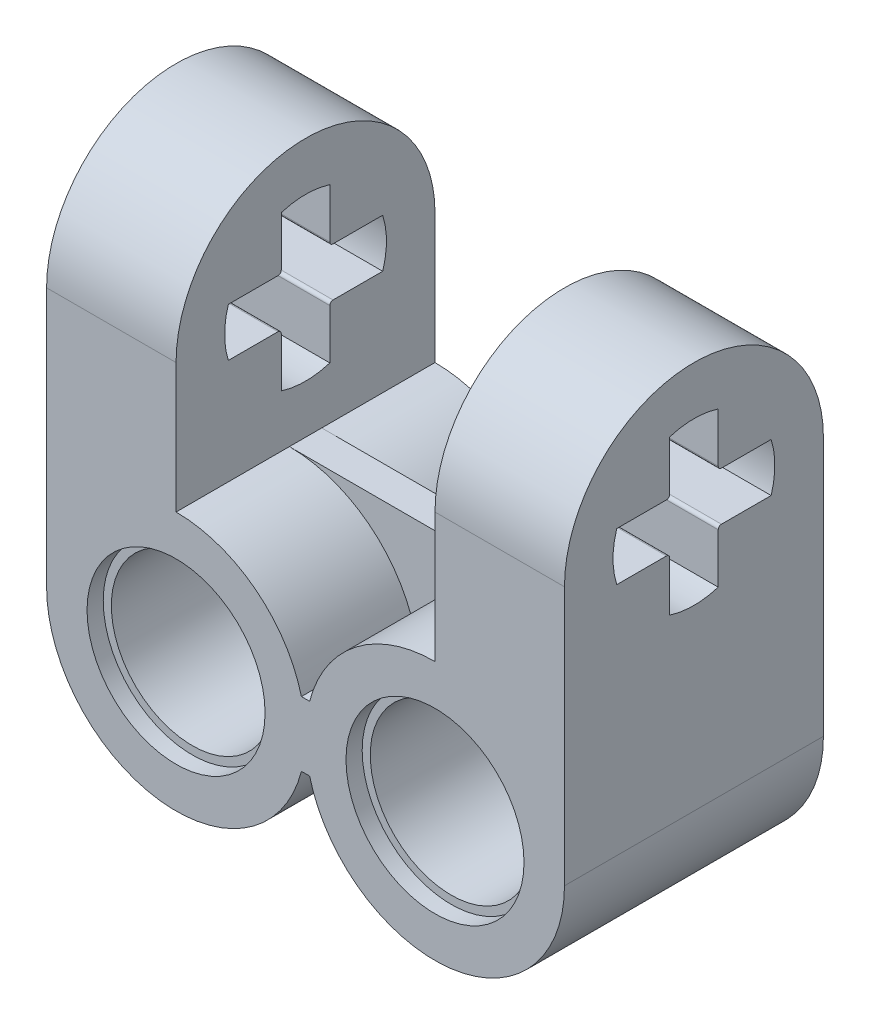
ISO-10303-21;
HEADER;
FILE_DESCRIPTION(('STEP AP214'),'2;1');
FILE_NAME('part.step','',(''),(''),'','','');
FILE_SCHEMA(('AUTOMOTIVE_DESIGN { 1 0 10303 214 1 1 1 1 }'));
ENDSEC;
DATA;
#1=APPLICATION_CONTEXT('core data for automotive mechanical design processes');
#2=APPLICATION_PROTOCOL_DEFINITION('international standard','automotive_design',2000,#1);
#3=PRODUCT_CONTEXT('',#1,'mechanical');
#4=PRODUCT('Part','Part','',(#3));
#5=PRODUCT_RELATED_PRODUCT_CATEGORY('part','',(#4));
#6=PRODUCT_DEFINITION_FORMATION('','',#4);
#7=PRODUCT_DEFINITION_CONTEXT('part definition',#1,'design');
#8=PRODUCT_DEFINITION('design','',#6,#7);
#9=PRODUCT_DEFINITION_SHAPE('','',#8);
#10=(LENGTH_UNIT() NAMED_UNIT(*) SI_UNIT(.MILLI.,.METRE.));
#11=(NAMED_UNIT(*) PLANE_ANGLE_UNIT() SI_UNIT($,.RADIAN.));
#12=(NAMED_UNIT(*) SI_UNIT($,.STERADIAN.) SOLID_ANGLE_UNIT());
#13=UNCERTAINTY_MEASURE_WITH_UNIT(LENGTH_MEASURE(1.E-05),#10,'distance_accuracy_value','');
#14=(GEOMETRIC_REPRESENTATION_CONTEXT(3) GLOBAL_UNCERTAINTY_ASSIGNED_CONTEXT((#13)) GLOBAL_UNIT_ASSIGNED_CONTEXT((#10,
#11,#12)) REPRESENTATION_CONTEXT('',''));
#15=CARTESIAN_POINT('',(0.,0.,0.));
#16=DIRECTION('',(0.,0.,1.));
#17=DIRECTION('',(1.,0.,0.));
#18=AXIS2_PLACEMENT_3D('',#15,#16,#17);
#19=CARTESIAN_POINT('',(4.,4.,3.5));
#20=DIRECTION('',(0.,0.,1.));
#21=DIRECTION('',(-1.,0.,0.));
#22=AXIS2_PLACEMENT_3D('',#19,#20,#21);
#23=PLANE('',#22);
#24=CARTESIAN_POINT('',(4.,4.,3.5));
#25=DIRECTION('',(0.,0.,-1.));
#26=DIRECTION('',(-1.,0.,0.));
#27=AXIS2_PLACEMENT_3D('',#24,#25,#26);
#28=CIRCLE('',#27,2.75);
#29=CARTESIAN_POINT('',(1.25,4.,3.5));
#30=VERTEX_POINT('',#29);
#31=EDGE_CURVE('E791',#30,#30,#28,.T.);
#32=ORIENTED_EDGE('',*,*,#31,.F.);
#33=EDGE_LOOP('',(#32));
#34=FACE_BOUND('',#33,.T.);
#35=CARTESIAN_POINT('',(4.,4.,3.5));
#36=DIRECTION('',(0.,0.,1.));
#37=DIRECTION('',(1.,0.,0.));
#38=AXIS2_PLACEMENT_3D('',#35,#36,#37);
#39=CIRCLE('',#38,2.5);
#40=CARTESIAN_POINT('',(6.5,4.,3.5));
#41=VERTEX_POINT('',#40);
#42=EDGE_CURVE('E784',#41,#41,#39,.F.);
#43=ORIENTED_EDGE('',*,*,#42,.T.);
#44=EDGE_LOOP('',(#43));
#45=FACE_BOUND('',#44,.T.);
#46=ADVANCED_FACE('F33',(#34,#45),#23,.T.);
#47=CARTESIAN_POINT('',(4.,4.,-3.5));
#48=DIRECTION('',(0.,0.,-1.));
#49=DIRECTION('',(-1.,0.,0.));
#50=AXIS2_PLACEMENT_3D('',#47,#48,#49);
#51=PLANE('',#50);
#52=CARTESIAN_POINT('',(4.,4.,-3.5));
#53=DIRECTION('',(0.,0.,-1.));
#54=DIRECTION('',(-1.,0.,0.));
#55=AXIS2_PLACEMENT_3D('',#52,#53,#54);
#56=CIRCLE('',#55,2.75);
#57=CARTESIAN_POINT('',(1.25,4.,-3.5));
#58=VERTEX_POINT('',#57);
#59=EDGE_CURVE('E776',#58,#58,#56,.T.);
#60=ORIENTED_EDGE('',*,*,#59,.T.);
#61=EDGE_LOOP('',(#60));
#62=FACE_BOUND('',#61,.T.);
#63=CARTESIAN_POINT('',(4.,4.,-3.5));
#64=DIRECTION('',(0.,0.,-1.));
#65=DIRECTION('',(-1.,0.,0.));
#66=AXIS2_PLACEMENT_3D('',#63,#64,#65);
#67=CIRCLE('',#66,2.5);
#68=CARTESIAN_POINT('',(1.5,4.,-3.5));
#69=VERTEX_POINT('',#68);
#70=EDGE_CURVE('E37',#69,#69,#67,.F.);
#71=ORIENTED_EDGE('',*,*,#70,.T.);
#72=EDGE_LOOP('',(#71));
#73=FACE_BOUND('',#72,.T.);
#74=ADVANCED_FACE('F830',(#62,#73),#51,.T.);
#75=CARTESIAN_POINT('',(-4.,4.,-4.));
#76=DIRECTION('',(0.,0.,1.));
#77=DIRECTION('',(1.,0.,0.));
#78=AXIS2_PLACEMENT_3D('',#75,#76,#77);
#79=CYLINDRICAL_SURFACE('',#78,2.5);
#80=CARTESIAN_POINT('',(-4.,4.,3.5));
#81=DIRECTION('',(0.,0.,1.));
#82=DIRECTION('',(1.,0.,0.));
#83=AXIS2_PLACEMENT_3D('',#80,#81,#82);
#84=CIRCLE('',#83,2.5);
#85=CARTESIAN_POINT('',(-1.5,4.,3.5));
#86=VERTEX_POINT('',#85);
#87=EDGE_CURVE('E427',#86,#86,#84,.F.);
#88=ORIENTED_EDGE('',*,*,#87,.F.);
#89=EDGE_LOOP('',(#88));
#90=FACE_BOUND('',#89,.T.);
#91=CARTESIAN_POINT('',(-4.,4.,-3.5));
#92=DIRECTION('',(0.,0.,-1.));
#93=DIRECTION('',(-1.,0.,0.));
#94=AXIS2_PLACEMENT_3D('',#91,#92,#93);
#95=CIRCLE('',#94,2.5);
#96=CARTESIAN_POINT('',(-6.5,4.,-3.5));
#97=VERTEX_POINT('',#96);
#98=EDGE_CURVE('E769',#97,#97,#95,.F.);
#99=ORIENTED_EDGE('',*,*,#98,.F.);
#100=EDGE_LOOP('',(#99));
#101=FACE_BOUND('',#100,.T.);
#102=ADVANCED_FACE('F835',(#90,#101),#79,.F.);
#103=CARTESIAN_POINT('',(4.,4.,-4.));
#104=DIRECTION('',(0.,0.,1.));
#105=DIRECTION('',(1.,0.,0.));
#106=AXIS2_PLACEMENT_3D('',#103,#104,#105);
#107=PLANE('',#106);
#108=CARTESIAN_POINT('',(-4.,4.,-4.));
#109=DIRECTION('',(0.,0.,1.));
#110=DIRECTION('',(-1.,0.,0.));
#111=AXIS2_PLACEMENT_3D('',#108,#109,#110);
#112=CIRCLE('',#111,4.);
#113=CARTESIAN_POINT('',(-8.,4.,-4.));
#114=VERTEX_POINT('',#113);
#115=CARTESIAN_POINT('',(-0.127016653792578,3.,-4.));
#116=VERTEX_POINT('',#115);
#117=EDGE_CURVE('E764',#114,#116,#112,.T.);
#118=ORIENTED_EDGE('',*,*,#117,.F.);
#119=DIRECTION('',(0.,1.,0.));
#120=VECTOR('',#119,1.);
#121=CARTESIAN_POINT('',(-8.,4.,-4.));
#122=LINE('',#121,#120);
#123=CARTESIAN_POINT('',(-8.,12.,-4.));
#124=VERTEX_POINT('',#123);
#125=EDGE_CURVE('E501',#114,#124,#122,.T.);
#126=ORIENTED_EDGE('',*,*,#125,.T.);
#127=DIRECTION('',(-1.,0.,0.));
#128=VECTOR('',#127,1.);
#129=CARTESIAN_POINT('',(-4.,12.,-4.));
#130=LINE('',#129,#128);
#131=CARTESIAN_POINT('',(-4.,12.,-4.));
#132=VERTEX_POINT('',#131);
#133=EDGE_CURVE('E512',#132,#124,#130,.T.);
#134=ORIENTED_EDGE('',*,*,#133,.F.);
#135=DIRECTION('',(0.,1.,0.));
#136=VECTOR('',#135,1.);
#137=CARTESIAN_POINT('',(-4.,4.,-4.));
#138=LINE('',#137,#136);
#139=CARTESIAN_POINT('',(-4.,8.,-4.));
#140=VERTEX_POINT('',#139);
#141=EDGE_CURVE('E503',#140,#132,#138,.T.);
#142=ORIENTED_EDGE('',*,*,#141,.F.);
#143=CARTESIAN_POINT('',(-0.127016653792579,5.,-4.));
#144=VERTEX_POINT('',#143);
#145=EDGE_CURVE('E765',#144,#140,#112,.T.);
#146=ORIENTED_EDGE('',*,*,#145,.F.);
#147=DIRECTION('',(1.,0.,0.));
#148=VECTOR('',#147,1.);
#149=CARTESIAN_POINT('',(-0.127016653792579,5.,-4.));
#150=LINE('',#149,#148);
#151=CARTESIAN_POINT('',(0.127016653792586,5.,-4.));
#152=VERTEX_POINT('',#151);
#153=EDGE_CURVE('E743',#144,#152,#150,.T.);
#154=ORIENTED_EDGE('',*,*,#153,.T.);
#155=CARTESIAN_POINT('',(4.,4.,-4.));
#156=DIRECTION('',(0.,0.,1.));
#157=DIRECTION('',(1.,0.,0.));
#158=AXIS2_PLACEMENT_3D('',#155,#156,#157);
#159=CIRCLE('',#158,4.);
#160=CARTESIAN_POINT('',(4.,8.,-4.));
#161=VERTEX_POINT('',#160);
#162=EDGE_CURVE('E752',#161,#152,#159,.T.);
#163=ORIENTED_EDGE('',*,*,#162,.F.);
#164=DIRECTION('',(0.,1.,0.));
#165=VECTOR('',#164,1.);
#166=CARTESIAN_POINT('',(4.,4.,-4.));
#167=LINE('',#166,#165);
#168=CARTESIAN_POINT('',(4.,12.,-4.));
#169=VERTEX_POINT('',#168);
#170=EDGE_CURVE('E649',#161,#169,#167,.T.);
#171=ORIENTED_EDGE('',*,*,#170,.T.);
#172=DIRECTION('',(1.,0.,0.));
#173=VECTOR('',#172,1.);
#174=CARTESIAN_POINT('',(4.,12.,-4.));
#175=LINE('',#174,#173);
#176=CARTESIAN_POINT('',(8.,12.,-4.));
#177=VERTEX_POINT('',#176);
#178=EDGE_CURVE('E658',#169,#177,#175,.T.);
#179=ORIENTED_EDGE('',*,*,#178,.T.);
#180=DIRECTION('',(0.,1.,0.));
#181=VECTOR('',#180,1.);
#182=CARTESIAN_POINT('',(8.,4.,-4.));
#183=LINE('',#182,#181);
#184=CARTESIAN_POINT('',(8.,4.,-4.));
#185=VERTEX_POINT('',#184);
#186=EDGE_CURVE('E661',#185,#177,#183,.T.);
#187=ORIENTED_EDGE('',*,*,#186,.F.);
#188=CARTESIAN_POINT('',(0.127016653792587,3.,-4.));
#189=VERTEX_POINT('',#188);
#190=EDGE_CURVE('E761',#189,#185,#159,.T.);
#191=ORIENTED_EDGE('',*,*,#190,.F.);
#192=DIRECTION('',(-1.,0.,0.));
#193=VECTOR('',#192,1.);
#194=CARTESIAN_POINT('',(-0.127016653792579,3.,-4.));
#195=LINE('',#194,#193);
#196=EDGE_CURVE('E729',#189,#116,#195,.T.);
#197=ORIENTED_EDGE('',*,*,#196,.T.);
#198=EDGE_LOOP('',(#118,#126,#134,#142,#146,#154,#163,#171,#179,#187,#191,#197));
#199=FACE_BOUND('',#198,.T.);
#200=CARTESIAN_POINT('',(4.,4.,-4.));
#201=DIRECTION('',(0.,0.,-1.));
#202=DIRECTION('',(-1.,0.,0.));
#203=AXIS2_PLACEMENT_3D('',#200,#201,#202);
#204=CIRCLE('',#203,2.75);
#205=CARTESIAN_POINT('',(1.25,4.,-4.));
#206=VERTEX_POINT('',#205);
#207=EDGE_CURVE('E771',#206,#206,#204,.T.);
#208=ORIENTED_EDGE('',*,*,#207,.F.);
#209=EDGE_LOOP('',(#208));
#210=FACE_BOUND('',#209,.T.);
#211=CARTESIAN_POINT('',(-4.,4.,-4.));
#212=DIRECTION('',(0.,0.,1.));
#213=DIRECTION('',(1.,0.,0.));
#214=AXIS2_PLACEMENT_3D('',#211,#212,#213);
#215=CIRCLE('',#214,2.75);
#216=CARTESIAN_POINT('',(-1.25,4.,-4.));
#217=VERTEX_POINT('',#216);
#218=EDGE_CURVE('E779',#217,#217,#215,.T.);
#219=ORIENTED_EDGE('',*,*,#218,.T.);
#220=EDGE_LOOP('',(#219));
#221=FACE_BOUND('',#220,.T.);
#222=ADVANCED_FACE('F807',(#199,#210,#221),#107,.F.);
#223=CARTESIAN_POINT('',(4.,4.,4.));
#224=DIRECTION('',(0.,0.,1.));
#225=DIRECTION('',(1.,0.,0.));
#226=AXIS2_PLACEMENT_3D('',#223,#224,#225);
#227=PLANE('',#226);
#228=CARTESIAN_POINT('',(-4.,4.,4.));
#229=DIRECTION('',(0.,0.,1.));
#230=DIRECTION('',(-1.,0.,0.));
#231=AXIS2_PLACEMENT_3D('',#228,#229,#230);
#232=CIRCLE('',#231,4.);
#233=CARTESIAN_POINT('',(-0.127016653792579,5.,4.));
#234=VERTEX_POINT('',#233);
#235=CARTESIAN_POINT('',(-4.,8.,4.));
#236=VERTEX_POINT('',#235);
#237=EDGE_CURVE('E11',#234,#236,#232,.T.);
#238=ORIENTED_EDGE('',*,*,#237,.T.);
#239=DIRECTION('',(0.,-1.,0.));
#240=VECTOR('',#239,1.);
#241=CARTESIAN_POINT('',(-4.,4.,4.));
#242=LINE('',#241,#240);
#243=CARTESIAN_POINT('',(-4.,12.,4.));
#244=VERTEX_POINT('',#243);
#245=EDGE_CURVE('E497',#244,#236,#242,.T.);
#246=ORIENTED_EDGE('',*,*,#245,.F.);
#247=DIRECTION('',(-1.,0.,0.));
#248=VECTOR('',#247,1.);
#249=CARTESIAN_POINT('',(-4.,12.,4.));
#250=LINE('',#249,#248);
#251=CARTESIAN_POINT('',(-8.,12.,4.));
#252=VERTEX_POINT('',#251);
#253=EDGE_CURVE('E505',#244,#252,#250,.T.);
#254=ORIENTED_EDGE('',*,*,#253,.T.);
#255=DIRECTION('',(0.,-1.,0.));
#256=VECTOR('',#255,1.);
#257=CARTESIAN_POINT('',(-8.,4.,4.));
#258=LINE('',#257,#256);
#259=CARTESIAN_POINT('',(-8.,4.,4.));
#260=VERTEX_POINT('',#259);
#261=EDGE_CURVE('E507',#252,#260,#258,.T.);
#262=ORIENTED_EDGE('',*,*,#261,.T.);
#263=CARTESIAN_POINT('',(-0.127016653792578,3.,4.));
#264=VERTEX_POINT('',#263);
#265=EDGE_CURVE('E42',#260,#264,#232,.T.);
#266=ORIENTED_EDGE('',*,*,#265,.T.);
#267=DIRECTION('',(-1.,0.,0.));
#268=VECTOR('',#267,1.);
#269=CARTESIAN_POINT('',(-0.127016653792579,3.,4.));
#270=LINE('',#269,#268);
#271=CARTESIAN_POINT('',(0.127016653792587,3.,4.));
#272=VERTEX_POINT('',#271);
#273=EDGE_CURVE('E728',#272,#264,#270,.T.);
#274=ORIENTED_EDGE('',*,*,#273,.F.);
#275=CARTESIAN_POINT('',(4.,4.,4.));
#276=DIRECTION('',(0.,0.,1.));
#277=DIRECTION('',(1.,0.,0.));
#278=AXIS2_PLACEMENT_3D('',#275,#276,#277);
#279=CIRCLE('',#278,4.);
#280=CARTESIAN_POINT('',(8.,4.,4.));
#281=VERTEX_POINT('',#280);
#282=EDGE_CURVE('E757',#272,#281,#279,.T.);
#283=ORIENTED_EDGE('',*,*,#282,.T.);
#284=DIRECTION('',(0.,-1.,0.));
#285=VECTOR('',#284,1.);
#286=CARTESIAN_POINT('',(8.,4.,4.));
#287=LINE('',#286,#285);
#288=CARTESIAN_POINT('',(8.,12.,4.));
#289=VERTEX_POINT('',#288);
#290=EDGE_CURVE('E652',#289,#281,#287,.T.);
#291=ORIENTED_EDGE('',*,*,#290,.F.);
#292=DIRECTION('',(1.,0.,0.));
#293=VECTOR('',#292,1.);
#294=CARTESIAN_POINT('',(4.,12.,4.));
#295=LINE('',#294,#293);
#296=CARTESIAN_POINT('',(4.,12.,4.));
#297=VERTEX_POINT('',#296);
#298=EDGE_CURVE('E668',#297,#289,#295,.T.);
#299=ORIENTED_EDGE('',*,*,#298,.F.);
#300=DIRECTION('',(0.,-1.,0.));
#301=VECTOR('',#300,1.);
#302=CARTESIAN_POINT('',(4.,4.,4.));
#303=LINE('',#302,#301);
#304=CARTESIAN_POINT('',(4.,8.,4.));
#305=VERTEX_POINT('',#304);
#306=EDGE_CURVE('E655',#297,#305,#303,.T.);
#307=ORIENTED_EDGE('',*,*,#306,.T.);
#308=CARTESIAN_POINT('',(0.127016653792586,5.,4.));
#309=VERTEX_POINT('',#308);
#310=EDGE_CURVE('E759',#305,#309,#279,.T.);
#311=ORIENTED_EDGE('',*,*,#310,.T.);
#312=DIRECTION('',(1.,0.,0.));
#313=VECTOR('',#312,1.);
#314=CARTESIAN_POINT('',(-0.127016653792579,5.,4.));
#315=LINE('',#314,#313);
#316=EDGE_CURVE('E738',#234,#309,#315,.T.);
#317=ORIENTED_EDGE('',*,*,#316,.F.);
#318=EDGE_LOOP('',(#238,#246,#254,#262,#266,#274,#283,#291,#299,#307,#311,#317));
#319=FACE_BOUND('',#318,.T.);
#320=CARTESIAN_POINT('',(-4.,4.,4.));
#321=DIRECTION('',(0.,0.,1.));
#322=DIRECTION('',(1.,0.,0.));
#323=AXIS2_PLACEMENT_3D('',#320,#321,#322);
#324=CIRCLE('',#323,2.75);
#325=CARTESIAN_POINT('',(-1.25,4.,4.));
#326=VERTEX_POINT('',#325);
#327=EDGE_CURVE('E396',#326,#326,#324,.T.);
#328=ORIENTED_EDGE('',*,*,#327,.F.);
#329=EDGE_LOOP('',(#328));
#330=FACE_BOUND('',#329,.T.);
#331=CARTESIAN_POINT('',(4.,4.,4.));
#332=DIRECTION('',(0.,0.,-1.));
#333=DIRECTION('',(-1.,0.,0.));
#334=AXIS2_PLACEMENT_3D('',#331,#332,#333);
#335=CIRCLE('',#334,2.75);
#336=CARTESIAN_POINT('',(1.25,4.,4.));
#337=VERTEX_POINT('',#336);
#338=EDGE_CURVE('E789',#337,#337,#335,.T.);
#339=ORIENTED_EDGE('',*,*,#338,.T.);
#340=EDGE_LOOP('',(#339));
#341=FACE_BOUND('',#340,.T.);
#342=ADVANCED_FACE('F803',(#319,#330,#341),#227,.T.);
#343=CARTESIAN_POINT('',(-4.,4.,4.));
#344=DIRECTION('',(0.,0.,-1.));
#345=DIRECTION('',(-1.,0.,0.));
#346=AXIS2_PLACEMENT_3D('',#343,#344,#345);
#347=CYLINDRICAL_SURFACE('',#346,4.);
#348=DIRECTION('',(0.,0.,-1.));
#349=VECTOR('',#348,1.);
#350=CARTESIAN_POINT('',(-4.,8.,4.));
#351=LINE('',#350,#349);
#352=CARTESIAN_POINT('',(-4.,7.99999999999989,0.5));
#353=VERTEX_POINT('',#352);
#354=EDGE_CURVE('E57',#236,#353,#351,.T.);
#355=ORIENTED_EDGE('',*,*,#354,.F.);
#356=ORIENTED_EDGE('',*,*,#237,.F.);
#357=DIRECTION('',(0.,0.,1.));
#358=VECTOR('',#357,1.);
#359=CARTESIAN_POINT('',(-0.127016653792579,5.,-4.));
#360=LINE('',#359,#358);
#361=CARTESIAN_POINT('',(-0.127016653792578,5.,0.5));
#362=VERTEX_POINT('',#361);
#363=EDGE_CURVE('E746',#362,#234,#360,.T.);
#364=ORIENTED_EDGE('',*,*,#363,.F.);
#365=CARTESIAN_POINT('',(-4.,4.,0.5));
#366=DIRECTION('',(0.,0.,-1.));
#367=DIRECTION('',(-1.,0.,0.));
#368=AXIS2_PLACEMENT_3D('',#365,#366,#367);
#369=CIRCLE('',#368,3.99999999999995);
#370=EDGE_CURVE('E702',#353,#362,#369,.T.);
#371=ORIENTED_EDGE('',*,*,#370,.F.);
#372=EDGE_LOOP('',(#355,#356,#364,#371));
#373=FACE_BOUND('',#372,.T.);
#374=ADVANCED_FACE('F806',(#373),#347,.T.);
#375=CARTESIAN_POINT('',(-4.,7.99999999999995,-0.5));
#376=VERTEX_POINT('',#375);
#377=EDGE_CURVE('E515',#376,#140,#351,.T.);
#378=ORIENTED_EDGE('',*,*,#377,.F.);
#379=CARTESIAN_POINT('',(-4.,4.,-0.5));
#380=DIRECTION('',(0.,0.,-1.));
#381=DIRECTION('',(-1.,0.,0.));
#382=AXIS2_PLACEMENT_3D('',#379,#380,#381);
#383=CIRCLE('',#382,3.99999999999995);
#384=CARTESIAN_POINT('',(-0.127016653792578,5.,-0.5));
#385=VERTEX_POINT('',#384);
#386=EDGE_CURVE('E701',#376,#385,#383,.T.);
#387=ORIENTED_EDGE('',*,*,#386,.T.);
#388=EDGE_CURVE('E754',#144,#385,#360,.T.);
#389=ORIENTED_EDGE('',*,*,#388,.F.);
#390=ORIENTED_EDGE('',*,*,#145,.T.);
#391=EDGE_LOOP('',(#378,#387,#389,#390));
#392=FACE_BOUND('',#391,.T.);
#393=ADVANCED_FACE('F1140',(#392),#347,.T.);
#394=DIRECTION('',(0.,0.,-1.));
#395=VECTOR('',#394,1.);
#396=CARTESIAN_POINT('',(-8.,4.,4.));
#397=LINE('',#396,#395);
#398=EDGE_CURVE('E469',#260,#114,#397,.T.);
#399=ORIENTED_EDGE('',*,*,#398,.T.);
#400=ORIENTED_EDGE('',*,*,#117,.T.);
#401=DIRECTION('',(0.,0.,1.));
#402=VECTOR('',#401,1.);
#403=CARTESIAN_POINT('',(-0.127016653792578,3.,-4.));
#404=LINE('',#403,#402);
#405=CARTESIAN_POINT('',(-0.127016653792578,3.,-0.5));
#406=VERTEX_POINT('',#405);
#407=EDGE_CURVE('E735',#116,#406,#404,.T.);
#408=ORIENTED_EDGE('',*,*,#407,.T.);
#409=CARTESIAN_POINT('',(-4.,4.,-0.5));
#410=DIRECTION('',(0.,0.,1.));
#411=DIRECTION('',(-1.,0.,0.));
#412=AXIS2_PLACEMENT_3D('',#409,#410,#411);
#413=CIRCLE('',#412,3.99999999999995);
#414=CARTESIAN_POINT('',(-4.,1.07552855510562E-13,-0.5));
#415=VERTEX_POINT('',#414);
#416=EDGE_CURVE('E688',#415,#406,#413,.T.);
#417=ORIENTED_EDGE('',*,*,#416,.F.);
#418=DIRECTION('',(0.,0.,-1.));
#419=VECTOR('',#418,1.);
#420=CARTESIAN_POINT('',(-4.,1.07552855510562E-13,0.5));
#421=LINE('',#420,#419);
#422=CARTESIAN_POINT('',(-4.,1.07552855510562E-13,0.5));
#423=VERTEX_POINT('',#422);
#424=EDGE_CURVE('E699',#423,#415,#421,.T.);
#425=ORIENTED_EDGE('',*,*,#424,.F.);
#426=CARTESIAN_POINT('',(-4.,4.,0.5));
#427=DIRECTION('',(0.,0.,1.));
#428=DIRECTION('',(-1.,0.,0.));
#429=AXIS2_PLACEMENT_3D('',#426,#427,#428);
#430=CIRCLE('',#429,3.99999999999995);
#431=CARTESIAN_POINT('',(-0.127016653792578,3.,0.5));
#432=VERTEX_POINT('',#431);
#433=EDGE_CURVE('E674',#423,#432,#430,.T.);
#434=ORIENTED_EDGE('',*,*,#433,.T.);
#435=EDGE_CURVE('E739',#432,#264,#404,.T.);
#436=ORIENTED_EDGE('',*,*,#435,.T.);
#437=ORIENTED_EDGE('',*,*,#265,.F.);
#438=EDGE_LOOP('',(#399,#400,#408,#417,#425,#434,#436,#437));
#439=FACE_BOUND('',#438,.T.);
#440=ADVANCED_FACE('F1135',(#439),#347,.T.);
#441=CARTESIAN_POINT('',(4.,4.,4.));
#442=DIRECTION('',(0.,0.,-1.));
#443=DIRECTION('',(-1.,0.,0.));
#444=AXIS2_PLACEMENT_3D('',#441,#442,#443);
#445=CYLINDRICAL_SURFACE('',#444,4.);
#446=DIRECTION('',(0.,0.,-1.));
#447=VECTOR('',#446,1.);
#448=CARTESIAN_POINT('',(4.,8.,4.));
#449=LINE('',#448,#447);
#450=CARTESIAN_POINT('',(4.,7.99999999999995,-0.5));
#451=VERTEX_POINT('',#450);
#452=EDGE_CURVE('E673',#161,#451,#449,.F.);
#453=ORIENTED_EDGE('',*,*,#452,.F.);
#454=ORIENTED_EDGE('',*,*,#162,.T.);
#455=DIRECTION('',(0.,0.,1.));
#456=VECTOR('',#455,1.);
#457=CARTESIAN_POINT('',(0.127016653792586,5.,-4.));
#458=LINE('',#457,#456);
#459=CARTESIAN_POINT('',(0.127016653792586,5.,-0.5));
#460=VERTEX_POINT('',#459);
#461=EDGE_CURVE('E749',#152,#460,#458,.T.);
#462=ORIENTED_EDGE('',*,*,#461,.T.);
#463=CARTESIAN_POINT('',(4.,4.,-0.5));
#464=DIRECTION('',(0.,0.,-1.));
#465=DIRECTION('',(1.,0.,0.));
#466=AXIS2_PLACEMENT_3D('',#463,#464,#465);
#467=CIRCLE('',#466,3.99999999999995);
#468=EDGE_CURVE('E718',#460,#451,#467,.T.);
#469=ORIENTED_EDGE('',*,*,#468,.T.);
#470=EDGE_LOOP('',(#453,#454,#462,#469));
#471=FACE_BOUND('',#470,.T.);
#472=ADVANCED_FACE('F35',(#471),#445,.T.);
#473=CARTESIAN_POINT('',(4.,7.99999999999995,0.5));
#474=VERTEX_POINT('',#473);
#475=EDGE_CURVE('E670',#474,#305,#449,.F.);
#476=ORIENTED_EDGE('',*,*,#475,.F.);
#477=CARTESIAN_POINT('',(4.,4.,0.5));
#478=DIRECTION('',(0.,0.,-1.));
#479=DIRECTION('',(1.,0.,0.));
#480=AXIS2_PLACEMENT_3D('',#477,#478,#479);
#481=CIRCLE('',#480,3.99999999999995);
#482=CARTESIAN_POINT('',(0.127016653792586,5.,0.5));
#483=VERTEX_POINT('',#482);
#484=EDGE_CURVE('E707',#483,#474,#481,.T.);
#485=ORIENTED_EDGE('',*,*,#484,.F.);
#486=EDGE_CURVE('E753',#483,#309,#458,.T.);
#487=ORIENTED_EDGE('',*,*,#486,.T.);
#488=ORIENTED_EDGE('',*,*,#310,.F.);
#489=EDGE_LOOP('',(#476,#485,#487,#488));
#490=FACE_BOUND('',#489,.T.);
#491=ADVANCED_FACE('F1371',(#490),#445,.T.);
#492=DIRECTION('',(0.,0.,-1.));
#493=VECTOR('',#492,1.);
#494=CARTESIAN_POINT('',(8.,4.,4.));
#495=LINE('',#494,#493);
#496=EDGE_CURVE('E618',#281,#185,#495,.T.);
#497=ORIENTED_EDGE('',*,*,#496,.F.);
#498=ORIENTED_EDGE('',*,*,#282,.F.);
#499=DIRECTION('',(0.,0.,1.));
#500=VECTOR('',#499,1.);
#501=CARTESIAN_POINT('',(0.127016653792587,3.,-4.));
#502=LINE('',#501,#500);
#503=CARTESIAN_POINT('',(0.127016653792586,3.,0.5));
#504=VERTEX_POINT('',#503);
#505=EDGE_CURVE('E732',#504,#272,#502,.T.);
#506=ORIENTED_EDGE('',*,*,#505,.F.);
#507=CARTESIAN_POINT('',(4.,4.,0.5));
#508=DIRECTION('',(0.,0.,1.));
#509=DIRECTION('',(1.,0.,0.));
#510=AXIS2_PLACEMENT_3D('',#507,#508,#509);
#511=CIRCLE('',#510,3.99999999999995);
#512=CARTESIAN_POINT('',(4.,0.,0.5));
#513=VERTEX_POINT('',#512);
#514=EDGE_CURVE('E681',#504,#513,#511,.T.);
#515=ORIENTED_EDGE('',*,*,#514,.T.);
#516=DIRECTION('',(0.,0.,-1.));
#517=VECTOR('',#516,1.);
#518=CARTESIAN_POINT('',(4.,0.,0.5));
#519=LINE('',#518,#517);
#520=CARTESIAN_POINT('',(4.,0.,-0.5));
#521=VERTEX_POINT('',#520);
#522=EDGE_CURVE('E687',#513,#521,#519,.T.);
#523=ORIENTED_EDGE('',*,*,#522,.T.);
#524=CARTESIAN_POINT('',(4.,4.,-0.5));
#525=DIRECTION('',(0.,0.,1.));
#526=DIRECTION('',(1.,0.,0.));
#527=AXIS2_PLACEMENT_3D('',#524,#525,#526);
#528=CIRCLE('',#527,3.99999999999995);
#529=CARTESIAN_POINT('',(0.127016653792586,3.,-0.5));
#530=VERTEX_POINT('',#529);
#531=EDGE_CURVE('E693',#530,#521,#528,.T.);
#532=ORIENTED_EDGE('',*,*,#531,.F.);
#533=EDGE_CURVE('E740',#189,#530,#502,.T.);
#534=ORIENTED_EDGE('',*,*,#533,.F.);
#535=ORIENTED_EDGE('',*,*,#190,.T.);
#536=EDGE_LOOP('',(#497,#498,#506,#515,#523,#532,#534,#535));
#537=FACE_BOUND('',#536,.T.);
#538=ADVANCED_FACE('F1365',(#537),#445,.T.);
#539=CARTESIAN_POINT('',(-0.127016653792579,3.,-4.));
#540=DIRECTION('',(0.,1.,0.));
#541=DIRECTION('',(-1.,0.,0.));
#542=AXIS2_PLACEMENT_3D('',#539,#540,#541);
#543=PLANE('',#542);
#544=DIRECTION('',(1.,0.,0.));
#545=VECTOR('',#544,1.);
#546=CARTESIAN_POINT('',(-0.127016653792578,3.,0.5));
#547=LINE('',#546,#545);
#548=EDGE_CURVE('E684',#432,#504,#547,.T.);
#549=ORIENTED_EDGE('',*,*,#548,.T.);
#550=ORIENTED_EDGE('',*,*,#505,.T.);
#551=ORIENTED_EDGE('',*,*,#273,.T.);
#552=ORIENTED_EDGE('',*,*,#435,.F.);
#553=EDGE_LOOP('',(#549,#550,#551,#552));
#554=FACE_BOUND('',#553,.T.);
#555=ADVANCED_FACE('F1370',(#554),#543,.F.);
#556=CARTESIAN_POINT('',(-0.127016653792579,5.,-4.));
#557=DIRECTION('',(0.,-1.,0.));
#558=DIRECTION('',(1.,0.,0.));
#559=AXIS2_PLACEMENT_3D('',#556,#557,#558);
#560=PLANE('',#559);
#561=DIRECTION('',(1.,0.,0.));
#562=VECTOR('',#561,1.);
#563=CARTESIAN_POINT('',(-0.127016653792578,5.,0.5));
#564=LINE('',#563,#562);
#565=EDGE_CURVE('E704',#362,#483,#564,.T.);
#566=ORIENTED_EDGE('',*,*,#565,.F.);
#567=ORIENTED_EDGE('',*,*,#363,.T.);
#568=ORIENTED_EDGE('',*,*,#316,.T.);
#569=ORIENTED_EDGE('',*,*,#486,.F.);
#570=EDGE_LOOP('',(#566,#567,#568,#569));
#571=FACE_BOUND('',#570,.T.);
#572=ADVANCED_FACE('F1436',(#571),#560,.F.);
#573=ORIENTED_EDGE('',*,*,#388,.T.);
#574=DIRECTION('',(1.,0.,0.));
#575=VECTOR('',#574,1.);
#576=CARTESIAN_POINT('',(-0.127016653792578,5.,-0.5));
#577=LINE('',#576,#575);
#578=EDGE_CURVE('E715',#385,#460,#577,.T.);
#579=ORIENTED_EDGE('',*,*,#578,.T.);
#580=ORIENTED_EDGE('',*,*,#461,.F.);
#581=ORIENTED_EDGE('',*,*,#153,.F.);
#582=EDGE_LOOP('',(#573,#579,#580,#581));
#583=FACE_BOUND('',#582,.T.);
#584=ADVANCED_FACE('F1426',(#583),#560,.F.);
#585=ORIENTED_EDGE('',*,*,#533,.T.);
#586=DIRECTION('',(1.,0.,0.));
#587=VECTOR('',#586,1.);
#588=CARTESIAN_POINT('',(-0.127016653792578,3.,-0.5));
#589=LINE('',#588,#587);
#590=EDGE_CURVE('E678',#406,#530,#589,.T.);
#591=ORIENTED_EDGE('',*,*,#590,.F.);
#592=ORIENTED_EDGE('',*,*,#407,.F.);
#593=ORIENTED_EDGE('',*,*,#196,.F.);
#594=EDGE_LOOP('',(#585,#591,#592,#593));
#595=FACE_BOUND('',#594,.T.);
#596=ADVANCED_FACE('F1127',(#595),#543,.F.);
#597=CARTESIAN_POINT('',(-4.,7.99999999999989,0.5));
#598=DIRECTION('',(0.,-1.,0.));
#599=DIRECTION('',(0.,0.,-1.));
#600=AXIS2_PLACEMENT_3D('',#597,#598,#599);
#601=PLANE('',#600);
#602=DIRECTION('',(-1.,0.,0.));
#603=VECTOR('',#602,1.);
#604=CARTESIAN_POINT('',(-4.,7.99999999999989,-0.5));
#605=LINE('',#604,#603);
#606=EDGE_CURVE('E705',#451,#376,#605,.T.);
#607=ORIENTED_EDGE('',*,*,#606,.T.);
#608=DIRECTION('',(0.,0.,-1.));
#609=VECTOR('',#608,1.);
#610=CARTESIAN_POINT('',(-4.,7.99999999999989,0.5));
#611=LINE('',#610,#609);
#612=EDGE_CURVE('E712',#353,#376,#611,.T.);
#613=ORIENTED_EDGE('',*,*,#612,.F.);
#614=DIRECTION('',(-1.,0.,0.));
#615=VECTOR('',#614,1.);
#616=CARTESIAN_POINT('',(-4.,7.99999999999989,0.5));
#617=LINE('',#616,#615);
#618=EDGE_CURVE('E710',#474,#353,#617,.T.);
#619=ORIENTED_EDGE('',*,*,#618,.F.);
#620=DIRECTION('',(0.,0.,-1.));
#621=VECTOR('',#620,1.);
#622=CARTESIAN_POINT('',(4.,7.99999999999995,0.5));
#623=LINE('',#622,#621);
#624=EDGE_CURVE('E725',#474,#451,#623,.T.);
#625=ORIENTED_EDGE('',*,*,#624,.T.);
#626=EDGE_LOOP('',(#607,#613,#619,#625));
#627=FACE_BOUND('',#626,.T.);
#628=ADVANCED_FACE('F1115',(#627),#601,.F.);
#629=CARTESIAN_POINT('',(-4.,4.,0.5));
#630=DIRECTION('',(0.,0.,-1.));
#631=DIRECTION('',(-1.,0.,0.));
#632=AXIS2_PLACEMENT_3D('',#629,#630,#631);
#633=PLANE('',#632);
#634=ORIENTED_EDGE('',*,*,#370,.T.);
#635=ORIENTED_EDGE('',*,*,#565,.T.);
#636=ORIENTED_EDGE('',*,*,#484,.T.);
#637=ORIENTED_EDGE('',*,*,#618,.T.);
#638=EDGE_LOOP('',(#634,#635,#636,#637));
#639=FACE_BOUND('',#638,.T.);
#640=ADVANCED_FACE('F1109',(#639),#633,.F.);
#641=CARTESIAN_POINT('',(-4.,4.,-0.5));
#642=DIRECTION('',(0.,0.,-1.));
#643=DIRECTION('',(-1.,0.,0.));
#644=AXIS2_PLACEMENT_3D('',#641,#642,#643);
#645=PLANE('',#644);
#646=ORIENTED_EDGE('',*,*,#386,.F.);
#647=ORIENTED_EDGE('',*,*,#606,.F.);
#648=ORIENTED_EDGE('',*,*,#468,.F.);
#649=ORIENTED_EDGE('',*,*,#578,.F.);
#650=EDGE_LOOP('',(#646,#647,#648,#649));
#651=FACE_BOUND('',#650,.T.);
#652=ADVANCED_FACE('F1114',(#651),#645,.T.);
#653=CARTESIAN_POINT('',(-4.,1.07552855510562E-13,0.5));
#654=DIRECTION('',(0.,-1.,0.));
#655=DIRECTION('',(0.,0.,-1.));
#656=AXIS2_PLACEMENT_3D('',#653,#654,#655);
#657=PLANE('',#656);
#658=DIRECTION('',(-1.,0.,0.));
#659=VECTOR('',#658,1.);
#660=CARTESIAN_POINT('',(-4.,1.07552855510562E-13,-0.5));
#661=LINE('',#660,#659);
#662=EDGE_CURVE('E690',#521,#415,#661,.T.);
#663=ORIENTED_EDGE('',*,*,#662,.F.);
#664=ORIENTED_EDGE('',*,*,#522,.F.);
#665=DIRECTION('',(-1.,0.,0.));
#666=VECTOR('',#665,1.);
#667=CARTESIAN_POINT('',(-4.,1.07552855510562E-13,0.5));
#668=LINE('',#667,#666);
#669=EDGE_CURVE('E677',#513,#423,#668,.T.);
#670=ORIENTED_EDGE('',*,*,#669,.T.);
#671=ORIENTED_EDGE('',*,*,#424,.T.);
#672=EDGE_LOOP('',(#663,#664,#670,#671));
#673=FACE_BOUND('',#672,.T.);
#674=ADVANCED_FACE('F1357',(#673),#657,.T.);
#675=CARTESIAN_POINT('',(-4.,4.,0.5));
#676=DIRECTION('',(0.,0.,-1.));
#677=DIRECTION('',(-1.,0.,0.));
#678=AXIS2_PLACEMENT_3D('',#675,#676,#677);
#679=PLANE('',#678);
#680=ORIENTED_EDGE('',*,*,#433,.F.);
#681=ORIENTED_EDGE('',*,*,#669,.F.);
#682=ORIENTED_EDGE('',*,*,#514,.F.);
#683=ORIENTED_EDGE('',*,*,#548,.F.);
#684=EDGE_LOOP('',(#680,#681,#682,#683));
#685=FACE_BOUND('',#684,.T.);
#686=ADVANCED_FACE('F1399',(#685),#679,.F.);
#687=CARTESIAN_POINT('',(-4.,4.,-0.5));
#688=DIRECTION('',(0.,0.,-1.));
#689=DIRECTION('',(-1.,0.,0.));
#690=AXIS2_PLACEMENT_3D('',#687,#688,#689);
#691=PLANE('',#690);
#692=ORIENTED_EDGE('',*,*,#416,.T.);
#693=ORIENTED_EDGE('',*,*,#590,.T.);
#694=ORIENTED_EDGE('',*,*,#531,.T.);
#695=ORIENTED_EDGE('',*,*,#662,.T.);
#696=EDGE_LOOP('',(#692,#693,#694,#695));
#697=FACE_BOUND('',#696,.T.);
#698=ADVANCED_FACE('F1347',(#697),#691,.T.);
#699=CARTESIAN_POINT('',(4.,12.,0.));
#700=DIRECTION('',(1.,0.,0.));
#701=DIRECTION('',(0.,0.,-1.));
#702=AXIS2_PLACEMENT_3D('',#699,#700,#701);
#703=PLANE('',#702);
#704=DIRECTION('',(0.,-1.,0.));
#705=VECTOR('',#704,1.);
#706=CARTESIAN_POINT('',(4.,9.61515199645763,0.750000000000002));
#707=LINE('',#706,#705);
#708=CARTESIAN_POINT('',(4.,11.15,0.750000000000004));
#709=VERTEX_POINT('',#708);
#710=CARTESIAN_POINT('',(4.,9.61515199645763,0.750000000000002));
#711=VERTEX_POINT('',#710);
#712=EDGE_CURVE('E566',#709,#711,#707,.T.);
#713=ORIENTED_EDGE('',*,*,#712,.T.);
#714=CARTESIAN_POINT('',(4.,12.,0.));
#715=DIRECTION('',(1.,0.,0.));
#716=DIRECTION('',(0.,0.,-1.));
#717=AXIS2_PLACEMENT_3D('',#714,#715,#716);
#718=CIRCLE('',#717,2.50000000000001);
#719=CARTESIAN_POINT('',(4.,9.61515199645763,-0.750000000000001));
#720=VERTEX_POINT('',#719);
#721=EDGE_CURVE('E520',#711,#720,#718,.T.);
#722=ORIENTED_EDGE('',*,*,#721,.T.);
#723=DIRECTION('',(0.,1.,0.));
#724=VECTOR('',#723,1.);
#725=CARTESIAN_POINT('',(4.,9.61515199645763,-0.750000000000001));
#726=LINE('',#725,#724);
#727=CARTESIAN_POINT('',(4.,11.15,-0.75));
#728=VERTEX_POINT('',#727);
#729=EDGE_CURVE('E523',#720,#728,#726,.T.);
#730=ORIENTED_EDGE('',*,*,#729,.T.);
#731=CARTESIAN_POINT('',(4.,11.15,-0.85));
#732=DIRECTION('',(-1.,0.,0.));
#733=DIRECTION('',(0.,0.,1.));
#734=AXIS2_PLACEMENT_3D('',#731,#732,#733);
#735=CIRCLE('',#734,0.0999999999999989);
#736=CARTESIAN_POINT('',(4.,11.25,-0.85));
#737=VERTEX_POINT('',#736);
#738=EDGE_CURVE('E527',#728,#737,#735,.T.);
#739=ORIENTED_EDGE('',*,*,#738,.T.);
#740=DIRECTION('',(0.,0.,-1.));
#741=VECTOR('',#740,1.);
#742=CARTESIAN_POINT('',(4.,11.25,-0.85));
#743=LINE('',#742,#741);
#744=CARTESIAN_POINT('',(4.,11.25,-2.38484800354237));
#745=VERTEX_POINT('',#744);
#746=EDGE_CURVE('E530',#737,#745,#743,.T.);
#747=ORIENTED_EDGE('',*,*,#746,.T.);
#748=CARTESIAN_POINT('',(4.,12.,0.));
#749=DIRECTION('',(1.,0.,0.));
#750=DIRECTION('',(0.,0.,1.));
#751=AXIS2_PLACEMENT_3D('',#748,#749,#750);
#752=CIRCLE('',#751,2.5);
#753=CARTESIAN_POINT('',(4.,12.75,-2.38484800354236));
#754=VERTEX_POINT('',#753);
#755=EDGE_CURVE('E533',#745,#754,#752,.T.);
#756=ORIENTED_EDGE('',*,*,#755,.T.);
#757=DIRECTION('',(0.,0.,1.));
#758=VECTOR('',#757,1.);
#759=CARTESIAN_POINT('',(4.,12.75,-0.849999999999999));
#760=LINE('',#759,#758);
#761=CARTESIAN_POINT('',(4.,12.75,-0.849999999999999));
#762=VERTEX_POINT('',#761);
#763=EDGE_CURVE('E536',#754,#762,#760,.T.);
#764=ORIENTED_EDGE('',*,*,#763,.T.);
#765=CARTESIAN_POINT('',(4.,12.85,-0.849999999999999));
#766=DIRECTION('',(-1.,0.,0.));
#767=DIRECTION('',(0.,0.,-1.));
#768=AXIS2_PLACEMENT_3D('',#765,#766,#767);
#769=CIRCLE('',#768,0.0999999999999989);
#770=CARTESIAN_POINT('',(4.,12.85,-0.749999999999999));
#771=VERTEX_POINT('',#770);
#772=EDGE_CURVE('E539',#762,#771,#769,.T.);
#773=ORIENTED_EDGE('',*,*,#772,.T.);
#774=DIRECTION('',(0.,1.,0.));
#775=VECTOR('',#774,1.);
#776=CARTESIAN_POINT('',(4.,14.3848480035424,-0.749999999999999));
#777=LINE('',#776,#775);
#778=CARTESIAN_POINT('',(4.,14.3848480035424,-0.749999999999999));
#779=VERTEX_POINT('',#778);
#780=EDGE_CURVE('E542',#771,#779,#777,.T.);
#781=ORIENTED_EDGE('',*,*,#780,.T.);
#782=CARTESIAN_POINT('',(4.,12.,0.));
#783=DIRECTION('',(1.,0.,0.));
#784=DIRECTION('',(0.,0.,1.));
#785=AXIS2_PLACEMENT_3D('',#782,#783,#784);
#786=CIRCLE('',#785,2.50000000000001);
#787=CARTESIAN_POINT('',(4.,14.3848480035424,0.750000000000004));
#788=VERTEX_POINT('',#787);
#789=EDGE_CURVE('E545',#779,#788,#786,.T.);
#790=ORIENTED_EDGE('',*,*,#789,.T.);
#791=DIRECTION('',(0.,-1.,0.));
#792=VECTOR('',#791,1.);
#793=CARTESIAN_POINT('',(4.,14.3848480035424,0.750000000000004));
#794=LINE('',#793,#792);
#795=CARTESIAN_POINT('',(4.,12.85,0.750000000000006));
#796=VERTEX_POINT('',#795);
#797=EDGE_CURVE('E548',#788,#796,#794,.T.);
#798=ORIENTED_EDGE('',*,*,#797,.T.);
#799=CARTESIAN_POINT('',(4.,12.85,0.850000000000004));
#800=DIRECTION('',(-1.,0.,0.));
#801=DIRECTION('',(0.,0.,1.));
#802=AXIS2_PLACEMENT_3D('',#799,#800,#801);
#803=CIRCLE('',#802,0.0999999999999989);
#804=CARTESIAN_POINT('',(4.,12.75,0.850000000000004));
#805=VERTEX_POINT('',#804);
#806=EDGE_CURVE('E551',#796,#805,#803,.T.);
#807=ORIENTED_EDGE('',*,*,#806,.T.);
#808=DIRECTION('',(0.,0.,1.));
#809=VECTOR('',#808,1.);
#810=CARTESIAN_POINT('',(4.,12.75,0.850000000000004));
#811=LINE('',#810,#809);
#812=CARTESIAN_POINT('',(4.,12.75,2.38484800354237));
#813=VERTEX_POINT('',#812);
#814=EDGE_CURVE('E554',#805,#813,#811,.T.);
#815=ORIENTED_EDGE('',*,*,#814,.T.);
#816=CARTESIAN_POINT('',(4.,12.,0.));
#817=DIRECTION('',(1.,0.,0.));
#818=DIRECTION('',(0.,0.,-1.));
#819=AXIS2_PLACEMENT_3D('',#816,#817,#818);
#820=CIRCLE('',#819,2.5);
#821=CARTESIAN_POINT('',(4.,11.25,2.38484800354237));
#822=VERTEX_POINT('',#821);
#823=EDGE_CURVE('E557',#813,#822,#820,.T.);
#824=ORIENTED_EDGE('',*,*,#823,.T.);
#825=DIRECTION('',(0.,0.,-1.));
#826=VECTOR('',#825,1.);
#827=CARTESIAN_POINT('',(4.,11.25,0.850000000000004));
#828=LINE('',#827,#826);
#829=CARTESIAN_POINT('',(4.,11.25,0.850000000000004));
#830=VERTEX_POINT('',#829);
#831=EDGE_CURVE('E560',#822,#830,#828,.T.);
#832=ORIENTED_EDGE('',*,*,#831,.T.);
#833=CARTESIAN_POINT('',(4.,11.15,0.850000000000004));
#834=DIRECTION('',(-1.,0.,0.));
#835=DIRECTION('',(0.,0.,-1.));
#836=AXIS2_PLACEMENT_3D('',#833,#834,#835);
#837=CIRCLE('',#836,0.0999999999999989);
#838=EDGE_CURVE('E563',#830,#709,#837,.T.);
#839=ORIENTED_EDGE('',*,*,#838,.T.);
#840=EDGE_LOOP('',(#713,#722,#730,#739,#747,#756,#764,#773,#781,#790,#798,#807,#815,#824,#832,#839));
#841=FACE_BOUND('',#840,.T.);
#842=ORIENTED_EDGE('',*,*,#170,.F.);
#843=ORIENTED_EDGE('',*,*,#452,.T.);
#844=ORIENTED_EDGE('',*,*,#624,.F.);
#845=ORIENTED_EDGE('',*,*,#475,.T.);
#846=ORIENTED_EDGE('',*,*,#306,.F.);
#847=CARTESIAN_POINT('',(4.,12.,0.));
#848=DIRECTION('',(1.,0.,0.));
#849=DIRECTION('',(0.,0.,-1.));
#850=AXIS2_PLACEMENT_3D('',#847,#848,#849);
#851=CIRCLE('',#850,4.);
#852=EDGE_CURVE('E651',#169,#297,#851,.T.);
#853=ORIENTED_EDGE('',*,*,#852,.F.);
#854=EDGE_LOOP('',(#842,#843,#844,#845,#846,#853));
#855=FACE_BOUND('',#854,.T.);
#856=ADVANCED_FACE('F1337',(#841,#855),#703,.F.);
#857=CARTESIAN_POINT('',(4.,12.,0.));
#858=DIRECTION('',(1.,0.,0.));
#859=DIRECTION('',(0.,0.,-1.));
#860=AXIS2_PLACEMENT_3D('',#857,#858,#859);
#861=CYLINDRICAL_SURFACE('',#860,4.);
#862=CARTESIAN_POINT('',(8.,12.,0.));
#863=DIRECTION('',(1.,0.,0.));
#864=DIRECTION('',(0.,0.,-1.));
#865=AXIS2_PLACEMENT_3D('',#862,#863,#864);
#866=CIRCLE('',#865,4.);
#867=EDGE_CURVE('E664',#177,#289,#866,.T.);
#868=ORIENTED_EDGE('',*,*,#867,.F.);
#869=ORIENTED_EDGE('',*,*,#178,.F.);
#870=ORIENTED_EDGE('',*,*,#852,.T.);
#871=ORIENTED_EDGE('',*,*,#298,.T.);
#872=EDGE_LOOP('',(#868,#869,#870,#871));
#873=FACE_BOUND('',#872,.T.);
#874=ADVANCED_FACE('F1327',(#873),#861,.T.);
#875=CARTESIAN_POINT('',(8.,12.,0.));
#876=DIRECTION('',(1.,0.,0.));
#877=DIRECTION('',(0.,0.,-1.));
#878=AXIS2_PLACEMENT_3D('',#875,#876,#877);
#879=PLANE('',#878);
#880=CARTESIAN_POINT('',(8.,12.,0.));
#881=DIRECTION('',(1.,0.,0.));
#882=DIRECTION('',(0.,0.,-1.));
#883=AXIS2_PLACEMENT_3D('',#880,#881,#882);
#884=CIRCLE('',#883,2.50000000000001);
#885=CARTESIAN_POINT('',(8.,9.61515199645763,0.750000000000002));
#886=VERTEX_POINT('',#885);
#887=CARTESIAN_POINT('',(8.,9.61515199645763,-0.750000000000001));
#888=VERTEX_POINT('',#887);
#889=EDGE_CURVE('E570',#886,#888,#884,.T.);
#890=ORIENTED_EDGE('',*,*,#889,.F.);
#891=DIRECTION('',(0.,-1.,0.));
#892=VECTOR('',#891,1.);
#893=CARTESIAN_POINT('',(8.,9.61515199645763,0.750000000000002));
#894=LINE('',#893,#892);
#895=CARTESIAN_POINT('',(8.,11.15,0.750000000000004));
#896=VERTEX_POINT('',#895);
#897=EDGE_CURVE('E524',#896,#886,#894,.T.);
#898=ORIENTED_EDGE('',*,*,#897,.F.);
#899=CARTESIAN_POINT('',(8.,11.15,0.850000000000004));
#900=DIRECTION('',(-1.,0.,0.));
#901=DIRECTION('',(0.,0.,-1.));
#902=AXIS2_PLACEMENT_3D('',#899,#900,#901);
#903=CIRCLE('',#902,0.0999999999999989);
#904=CARTESIAN_POINT('',(8.,11.25,0.850000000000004));
#905=VERTEX_POINT('',#904);
#906=EDGE_CURVE('E611',#905,#896,#903,.T.);
#907=ORIENTED_EDGE('',*,*,#906,.F.);
#908=DIRECTION('',(0.,0.,-1.));
#909=VECTOR('',#908,1.);
#910=CARTESIAN_POINT('',(8.,11.25,0.850000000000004));
#911=LINE('',#910,#909);
#912=CARTESIAN_POINT('',(8.,11.25,2.38484800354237));
#913=VERTEX_POINT('',#912);
#914=EDGE_CURVE('E608',#913,#905,#911,.T.);
#915=ORIENTED_EDGE('',*,*,#914,.F.);
#916=CARTESIAN_POINT('',(8.,12.,0.));
#917=DIRECTION('',(1.,0.,0.));
#918=DIRECTION('',(0.,0.,-1.));
#919=AXIS2_PLACEMENT_3D('',#916,#917,#918);
#920=CIRCLE('',#919,2.5);
#921=CARTESIAN_POINT('',(8.,12.75,2.38484800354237));
#922=VERTEX_POINT('',#921);
#923=EDGE_CURVE('E605',#922,#913,#920,.T.);
#924=ORIENTED_EDGE('',*,*,#923,.F.);
#925=DIRECTION('',(0.,0.,1.));
#926=VECTOR('',#925,1.);
#927=CARTESIAN_POINT('',(8.,12.75,0.850000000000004));
#928=LINE('',#927,#926);
#929=CARTESIAN_POINT('',(8.,12.75,0.850000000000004));
#930=VERTEX_POINT('',#929);
#931=EDGE_CURVE('E602',#930,#922,#928,.T.);
#932=ORIENTED_EDGE('',*,*,#931,.F.);
#933=CARTESIAN_POINT('',(8.,12.85,0.850000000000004));
#934=DIRECTION('',(-1.,0.,0.));
#935=DIRECTION('',(0.,0.,1.));
#936=AXIS2_PLACEMENT_3D('',#933,#934,#935);
#937=CIRCLE('',#936,0.0999999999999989);
#938=CARTESIAN_POINT('',(8.,12.85,0.750000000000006));
#939=VERTEX_POINT('',#938);
#940=EDGE_CURVE('E599',#939,#930,#937,.T.);
#941=ORIENTED_EDGE('',*,*,#940,.F.);
#942=DIRECTION('',(0.,-1.,0.));
#943=VECTOR('',#942,1.);
#944=CARTESIAN_POINT('',(8.,14.3848480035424,0.750000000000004));
#945=LINE('',#944,#943);
#946=CARTESIAN_POINT('',(8.,14.3848480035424,0.750000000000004));
#947=VERTEX_POINT('',#946);
#948=EDGE_CURVE('E596',#947,#939,#945,.T.);
#949=ORIENTED_EDGE('',*,*,#948,.F.);
#950=CARTESIAN_POINT('',(8.,12.,0.));
#951=DIRECTION('',(1.,0.,0.));
#952=DIRECTION('',(0.,0.,1.));
#953=AXIS2_PLACEMENT_3D('',#950,#951,#952);
#954=CIRCLE('',#953,2.50000000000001);
#955=CARTESIAN_POINT('',(8.,14.3848480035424,-0.749999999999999));
#956=VERTEX_POINT('',#955);
#957=EDGE_CURVE('E593',#956,#947,#954,.T.);
#958=ORIENTED_EDGE('',*,*,#957,.F.);
#959=DIRECTION('',(0.,1.,0.));
#960=VECTOR('',#959,1.);
#961=CARTESIAN_POINT('',(8.,14.3848480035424,-0.749999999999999));
#962=LINE('',#961,#960);
#963=CARTESIAN_POINT('',(8.,12.85,-0.749999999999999));
#964=VERTEX_POINT('',#963);
#965=EDGE_CURVE('E590',#964,#956,#962,.T.);
#966=ORIENTED_EDGE('',*,*,#965,.F.);
#967=CARTESIAN_POINT('',(8.,12.85,-0.849999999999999));
#968=DIRECTION('',(-1.,0.,0.));
#969=DIRECTION('',(0.,0.,-1.));
#970=AXIS2_PLACEMENT_3D('',#967,#968,#969);
#971=CIRCLE('',#970,0.0999999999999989);
#972=CARTESIAN_POINT('',(8.,12.75,-0.849999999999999));
#973=VERTEX_POINT('',#972);
#974=EDGE_CURVE('E587',#973,#964,#971,.T.);
#975=ORIENTED_EDGE('',*,*,#974,.F.);
#976=DIRECTION('',(0.,0.,1.));
#977=VECTOR('',#976,1.);
#978=CARTESIAN_POINT('',(8.,12.75,-0.849999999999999));
#979=LINE('',#978,#977);
#980=CARTESIAN_POINT('',(8.,12.75,-2.38484800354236));
#981=VERTEX_POINT('',#980);
#982=EDGE_CURVE('E584',#981,#973,#979,.T.);
#983=ORIENTED_EDGE('',*,*,#982,.F.);
#984=CARTESIAN_POINT('',(8.,12.,0.));
#985=DIRECTION('',(1.,0.,0.));
#986=DIRECTION('',(0.,0.,1.));
#987=AXIS2_PLACEMENT_3D('',#984,#985,#986);
#988=CIRCLE('',#987,2.5);
#989=CARTESIAN_POINT('',(8.,11.25,-2.38484800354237));
#990=VERTEX_POINT('',#989);
#991=EDGE_CURVE('E581',#990,#981,#988,.T.);
#992=ORIENTED_EDGE('',*,*,#991,.F.);
#993=DIRECTION('',(0.,0.,-1.));
#994=VECTOR('',#993,1.);
#995=CARTESIAN_POINT('',(8.,11.25,-0.85));
#996=LINE('',#995,#994);
#997=CARTESIAN_POINT('',(8.,11.25,-0.85));
#998=VERTEX_POINT('',#997);
#999=EDGE_CURVE('E578',#998,#990,#996,.T.);
#1000=ORIENTED_EDGE('',*,*,#999,.F.);
#1001=CARTESIAN_POINT('',(8.,11.15,-0.85));
#1002=DIRECTION('',(-1.,0.,0.));
#1003=DIRECTION('',(0.,0.,1.));
#1004=AXIS2_PLACEMENT_3D('',#1001,#1002,#1003);
#1005=CIRCLE('',#1004,0.0999999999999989);
#1006=CARTESIAN_POINT('',(8.,11.15,-0.750000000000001));
#1007=VERTEX_POINT('',#1006);
#1008=EDGE_CURVE('E575',#1007,#998,#1005,.T.);
#1009=ORIENTED_EDGE('',*,*,#1008,.F.);
#1010=DIRECTION('',(0.,1.,0.));
#1011=VECTOR('',#1010,1.);
#1012=CARTESIAN_POINT('',(8.,9.61515199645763,-0.750000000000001));
#1013=LINE('',#1012,#1011);
#1014=EDGE_CURVE('E572',#888,#1007,#1013,.T.);
#1015=ORIENTED_EDGE('',*,*,#1014,.F.);
#1016=EDGE_LOOP('',(#890,#898,#907,#915,#924,#932,#941,#949,#958,#966,#975,#983,#992,#1000,
#1009,#1015));
#1017=FACE_BOUND('',#1016,.T.);
#1018=ORIENTED_EDGE('',*,*,#496,.T.);
#1019=ORIENTED_EDGE('',*,*,#186,.T.);
#1020=ORIENTED_EDGE('',*,*,#867,.T.);
#1021=ORIENTED_EDGE('',*,*,#290,.T.);
#1022=EDGE_LOOP('',(#1018,#1019,#1020,#1021));
#1023=FACE_BOUND('',#1022,.T.);
#1024=ADVANCED_FACE('F1317',(#1017,#1023),#879,.T.);
#1025=CARTESIAN_POINT('',(4.,12.,0.));
#1026=DIRECTION('',(1.,0.,0.));
#1027=DIRECTION('',(0.,0.,-1.));
#1028=AXIS2_PLACEMENT_3D('',#1025,#1026,#1027);
#1029=CYLINDRICAL_SURFACE('',#1028,2.50000000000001);
#1030=ORIENTED_EDGE('',*,*,#889,.T.);
#1031=DIRECTION('',(1.,0.,0.));
#1032=VECTOR('',#1031,1.);
#1033=CARTESIAN_POINT('',(4.,9.61515199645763,-0.750000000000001));
#1034=LINE('',#1033,#1032);
#1035=EDGE_CURVE('E569',#720,#888,#1034,.T.);
#1036=ORIENTED_EDGE('',*,*,#1035,.F.);
#1037=ORIENTED_EDGE('',*,*,#721,.F.);
#1038=DIRECTION('',(1.,0.,0.));
#1039=VECTOR('',#1038,1.);
#1040=CARTESIAN_POINT('',(4.,9.61515199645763,0.750000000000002));
#1041=LINE('',#1040,#1039);
#1042=EDGE_CURVE('E616',#711,#886,#1041,.T.);
#1043=ORIENTED_EDGE('',*,*,#1042,.T.);
#1044=EDGE_LOOP('',(#1030,#1036,#1037,#1043));
#1045=FACE_BOUND('',#1044,.T.);
#1046=ADVANCED_FACE('F1307',(#1045),#1029,.F.);
#1047=CARTESIAN_POINT('',(4.,9.61515199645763,0.750000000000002));
#1048=DIRECTION('',(0.,0.,1.));
#1049=DIRECTION('',(0.,-1.,0.));
#1050=AXIS2_PLACEMENT_3D('',#1047,#1048,#1049);
#1051=PLANE('',#1050);
#1052=ORIENTED_EDGE('',*,*,#897,.T.);
#1053=ORIENTED_EDGE('',*,*,#1042,.F.);
#1054=ORIENTED_EDGE('',*,*,#712,.F.);
#1055=DIRECTION('',(1.,0.,0.));
#1056=VECTOR('',#1055,1.);
#1057=CARTESIAN_POINT('',(4.,11.15,0.750000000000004));
#1058=LINE('',#1057,#1056);
#1059=EDGE_CURVE('E619',#709,#896,#1058,.T.);
#1060=ORIENTED_EDGE('',*,*,#1059,.T.);
#1061=EDGE_LOOP('',(#1052,#1053,#1054,#1060));
#1062=FACE_BOUND('',#1061,.T.);
#1063=ADVANCED_FACE('F1297',(#1062),#1051,.F.);
#1064=CARTESIAN_POINT('',(4.,11.15,0.850000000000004));
#1065=DIRECTION('',(1.,0.,0.));
#1066=DIRECTION('',(0.,0.,-1.));
#1067=AXIS2_PLACEMENT_3D('',#1064,#1065,#1066);
#1068=CYLINDRICAL_SURFACE('',#1067,0.0999999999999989);
#1069=ORIENTED_EDGE('',*,*,#906,.T.);
#1070=ORIENTED_EDGE('',*,*,#1059,.F.);
#1071=ORIENTED_EDGE('',*,*,#838,.F.);
#1072=DIRECTION('',(1.,0.,0.));
#1073=VECTOR('',#1072,1.);
#1074=CARTESIAN_POINT('',(4.,11.25,0.850000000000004));
#1075=LINE('',#1074,#1073);
#1076=EDGE_CURVE('E621',#830,#905,#1075,.T.);
#1077=ORIENTED_EDGE('',*,*,#1076,.T.);
#1078=EDGE_LOOP('',(#1069,#1070,#1071,#1077));
#1079=FACE_BOUND('',#1078,.T.);
#1080=ADVANCED_FACE('F1287',(#1079),#1068,.T.);
#1081=CARTESIAN_POINT('',(4.,11.25,0.850000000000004));
#1082=DIRECTION('',(0.,-1.,0.));
#1083=DIRECTION('',(0.,0.,-1.));
#1084=AXIS2_PLACEMENT_3D('',#1081,#1082,#1083);
#1085=PLANE('',#1084);
#1086=ORIENTED_EDGE('',*,*,#914,.T.);
#1087=ORIENTED_EDGE('',*,*,#1076,.F.);
#1088=ORIENTED_EDGE('',*,*,#831,.F.);
#1089=DIRECTION('',(1.,0.,0.));
#1090=VECTOR('',#1089,1.);
#1091=CARTESIAN_POINT('',(4.,11.25,2.38484800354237));
#1092=LINE('',#1091,#1090);
#1093=EDGE_CURVE('E623',#822,#913,#1092,.T.);
#1094=ORIENTED_EDGE('',*,*,#1093,.T.);
#1095=EDGE_LOOP('',(#1086,#1087,#1088,#1094));
#1096=FACE_BOUND('',#1095,.T.);
#1097=ADVANCED_FACE('F1277',(#1096),#1085,.F.);
#1098=CARTESIAN_POINT('',(4.,12.,0.));
#1099=DIRECTION('',(1.,0.,0.));
#1100=DIRECTION('',(0.,0.,-1.));
#1101=AXIS2_PLACEMENT_3D('',#1098,#1099,#1100);
#1102=CYLINDRICAL_SURFACE('',#1101,2.5);
#1103=ORIENTED_EDGE('',*,*,#923,.T.);
#1104=ORIENTED_EDGE('',*,*,#1093,.F.);
#1105=ORIENTED_EDGE('',*,*,#823,.F.);
#1106=DIRECTION('',(1.,0.,0.));
#1107=VECTOR('',#1106,1.);
#1108=CARTESIAN_POINT('',(4.,12.75,2.38484800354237));
#1109=LINE('',#1108,#1107);
#1110=EDGE_CURVE('E625',#813,#922,#1109,.T.);
#1111=ORIENTED_EDGE('',*,*,#1110,.T.);
#1112=EDGE_LOOP('',(#1103,#1104,#1105,#1111));
#1113=FACE_BOUND('',#1112,.T.);
#1114=ADVANCED_FACE('F1267',(#1113),#1102,.F.);
#1115=CARTESIAN_POINT('',(4.,12.75,0.850000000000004));
#1116=DIRECTION('',(0.,1.,0.));
#1117=DIRECTION('',(0.,0.,1.));
#1118=AXIS2_PLACEMENT_3D('',#1115,#1116,#1117);
#1119=PLANE('',#1118);
#1120=ORIENTED_EDGE('',*,*,#931,.T.);
#1121=ORIENTED_EDGE('',*,*,#1110,.F.);
#1122=ORIENTED_EDGE('',*,*,#814,.F.);
#1123=DIRECTION('',(1.,0.,0.));
#1124=VECTOR('',#1123,1.);
#1125=CARTESIAN_POINT('',(4.,12.75,0.850000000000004));
#1126=LINE('',#1125,#1124);
#1127=EDGE_CURVE('E627',#805,#930,#1126,.T.);
#1128=ORIENTED_EDGE('',*,*,#1127,.T.);
#1129=EDGE_LOOP('',(#1120,#1121,#1122,#1128));
#1130=FACE_BOUND('',#1129,.T.);
#1131=ADVANCED_FACE('F1257',(#1130),#1119,.F.);
#1132=CARTESIAN_POINT('',(4.,12.85,0.850000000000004));
#1133=DIRECTION('',(1.,0.,0.));
#1134=DIRECTION('',(0.,0.,-1.));
#1135=AXIS2_PLACEMENT_3D('',#1132,#1133,#1134);
#1136=CYLINDRICAL_SURFACE('',#1135,0.0999999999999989);
#1137=ORIENTED_EDGE('',*,*,#940,.T.);
#1138=ORIENTED_EDGE('',*,*,#1127,.F.);
#1139=ORIENTED_EDGE('',*,*,#806,.F.);
#1140=DIRECTION('',(1.,0.,0.));
#1141=VECTOR('',#1140,1.);
#1142=CARTESIAN_POINT('',(4.,12.85,0.750000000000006));
#1143=LINE('',#1142,#1141);
#1144=EDGE_CURVE('E629',#796,#939,#1143,.T.);
#1145=ORIENTED_EDGE('',*,*,#1144,.T.);
#1146=EDGE_LOOP('',(#1137,#1138,#1139,#1145));
#1147=FACE_BOUND('',#1146,.T.);
#1148=ADVANCED_FACE('F1247',(#1147),#1136,.T.);
#1149=CARTESIAN_POINT('',(4.,14.3848480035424,0.750000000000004));
#1150=DIRECTION('',(0.,0.,1.));
#1151=DIRECTION('',(0.,-1.,0.));
#1152=AXIS2_PLACEMENT_3D('',#1149,#1150,#1151);
#1153=PLANE('',#1152);
#1154=ORIENTED_EDGE('',*,*,#948,.T.);
#1155=ORIENTED_EDGE('',*,*,#1144,.F.);
#1156=ORIENTED_EDGE('',*,*,#797,.F.);
#1157=DIRECTION('',(1.,0.,0.));
#1158=VECTOR('',#1157,1.);
#1159=CARTESIAN_POINT('',(4.,14.3848480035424,0.750000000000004));
#1160=LINE('',#1159,#1158);
#1161=EDGE_CURVE('E631',#788,#947,#1160,.T.);
#1162=ORIENTED_EDGE('',*,*,#1161,.T.);
#1163=EDGE_LOOP('',(#1154,#1155,#1156,#1162));
#1164=FACE_BOUND('',#1163,.T.);
#1165=ADVANCED_FACE('F1237',(#1164),#1153,.F.);
#1166=CARTESIAN_POINT('',(4.,12.,0.));
#1167=DIRECTION('',(1.,0.,0.));
#1168=DIRECTION('',(0.,0.,-1.));
#1169=AXIS2_PLACEMENT_3D('',#1166,#1167,#1168);
#1170=CYLINDRICAL_SURFACE('',#1169,2.50000000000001);
#1171=ORIENTED_EDGE('',*,*,#957,.T.);
#1172=ORIENTED_EDGE('',*,*,#1161,.F.);
#1173=ORIENTED_EDGE('',*,*,#789,.F.);
#1174=DIRECTION('',(1.,0.,0.));
#1175=VECTOR('',#1174,1.);
#1176=CARTESIAN_POINT('',(4.,14.3848480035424,-0.749999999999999));
#1177=LINE('',#1176,#1175);
#1178=EDGE_CURVE('E633',#779,#956,#1177,.T.);
#1179=ORIENTED_EDGE('',*,*,#1178,.T.);
#1180=EDGE_LOOP('',(#1171,#1172,#1173,#1179));
#1181=FACE_BOUND('',#1180,.T.);
#1182=ADVANCED_FACE('F1227',(#1181),#1170,.F.);
#1183=CARTESIAN_POINT('',(4.,14.3848480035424,-0.749999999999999));
#1184=DIRECTION('',(0.,0.,-1.));
#1185=DIRECTION('',(0.,1.,0.));
#1186=AXIS2_PLACEMENT_3D('',#1183,#1184,#1185);
#1187=PLANE('',#1186);
#1188=ORIENTED_EDGE('',*,*,#965,.T.);
#1189=ORIENTED_EDGE('',*,*,#1178,.F.);
#1190=ORIENTED_EDGE('',*,*,#780,.F.);
#1191=DIRECTION('',(1.,0.,0.));
#1192=VECTOR('',#1191,1.);
#1193=CARTESIAN_POINT('',(4.,12.85,-0.749999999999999));
#1194=LINE('',#1193,#1192);
#1195=EDGE_CURVE('E635',#771,#964,#1194,.T.);
#1196=ORIENTED_EDGE('',*,*,#1195,.T.);
#1197=EDGE_LOOP('',(#1188,#1189,#1190,#1196));
#1198=FACE_BOUND('',#1197,.T.);
#1199=ADVANCED_FACE('F1217',(#1198),#1187,.F.);
#1200=CARTESIAN_POINT('',(4.,12.85,-0.849999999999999));
#1201=DIRECTION('',(1.,0.,0.));
#1202=DIRECTION('',(0.,0.,-1.));
#1203=AXIS2_PLACEMENT_3D('',#1200,#1201,#1202);
#1204=CYLINDRICAL_SURFACE('',#1203,0.0999999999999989);
#1205=ORIENTED_EDGE('',*,*,#974,.T.);
#1206=ORIENTED_EDGE('',*,*,#1195,.F.);
#1207=ORIENTED_EDGE('',*,*,#772,.F.);
#1208=DIRECTION('',(1.,0.,0.));
#1209=VECTOR('',#1208,1.);
#1210=CARTESIAN_POINT('',(4.,12.75,-0.849999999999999));
#1211=LINE('',#1210,#1209);
#1212=EDGE_CURVE('E637',#762,#973,#1211,.T.);
#1213=ORIENTED_EDGE('',*,*,#1212,.T.);
#1214=EDGE_LOOP('',(#1205,#1206,#1207,#1213));
#1215=FACE_BOUND('',#1214,.T.);
#1216=ADVANCED_FACE('F1207',(#1215),#1204,.T.);
#1217=CARTESIAN_POINT('',(4.,12.75,-0.849999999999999));
#1218=DIRECTION('',(0.,1.,0.));
#1219=DIRECTION('',(0.,0.,1.));
#1220=AXIS2_PLACEMENT_3D('',#1217,#1218,#1219);
#1221=PLANE('',#1220);
#1222=ORIENTED_EDGE('',*,*,#982,.T.);
#1223=ORIENTED_EDGE('',*,*,#1212,.F.);
#1224=ORIENTED_EDGE('',*,*,#763,.F.);
#1225=DIRECTION('',(1.,0.,0.));
#1226=VECTOR('',#1225,1.);
#1227=CARTESIAN_POINT('',(4.,12.75,-2.38484800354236));
#1228=LINE('',#1227,#1226);
#1229=EDGE_CURVE('E639',#754,#981,#1228,.T.);
#1230=ORIENTED_EDGE('',*,*,#1229,.T.);
#1231=EDGE_LOOP('',(#1222,#1223,#1224,#1230));
#1232=FACE_BOUND('',#1231,.T.);
#1233=ADVANCED_FACE('F1197',(#1232),#1221,.F.);
#1234=CARTESIAN_POINT('',(4.,12.,0.));
#1235=DIRECTION('',(1.,0.,0.));
#1236=DIRECTION('',(0.,0.,-1.));
#1237=AXIS2_PLACEMENT_3D('',#1234,#1235,#1236);
#1238=CYLINDRICAL_SURFACE('',#1237,2.5);
#1239=ORIENTED_EDGE('',*,*,#991,.T.);
#1240=ORIENTED_EDGE('',*,*,#1229,.F.);
#1241=ORIENTED_EDGE('',*,*,#755,.F.);
#1242=DIRECTION('',(1.,0.,0.));
#1243=VECTOR('',#1242,1.);
#1244=CARTESIAN_POINT('',(4.,11.25,-2.38484800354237));
#1245=LINE('',#1244,#1243);
#1246=EDGE_CURVE('E641',#745,#990,#1245,.T.);
#1247=ORIENTED_EDGE('',*,*,#1246,.T.);
#1248=EDGE_LOOP('',(#1239,#1240,#1241,#1247));
#1249=FACE_BOUND('',#1248,.T.);
#1250=ADVANCED_FACE('F1187',(#1249),#1238,.F.);
#1251=CARTESIAN_POINT('',(4.,11.25,-0.85));
#1252=DIRECTION('',(0.,-1.,0.));
#1253=DIRECTION('',(0.,0.,-1.));
#1254=AXIS2_PLACEMENT_3D('',#1251,#1252,#1253);
#1255=PLANE('',#1254);
#1256=ORIENTED_EDGE('',*,*,#999,.T.);
#1257=ORIENTED_EDGE('',*,*,#1246,.F.);
#1258=ORIENTED_EDGE('',*,*,#746,.F.);
#1259=DIRECTION('',(1.,0.,0.));
#1260=VECTOR('',#1259,1.);
#1261=CARTESIAN_POINT('',(4.,11.25,-0.85));
#1262=LINE('',#1261,#1260);
#1263=EDGE_CURVE('E643',#737,#998,#1262,.T.);
#1264=ORIENTED_EDGE('',*,*,#1263,.T.);
#1265=EDGE_LOOP('',(#1256,#1257,#1258,#1264));
#1266=FACE_BOUND('',#1265,.T.);
#1267=ADVANCED_FACE('F1177',(#1266),#1255,.F.);
#1268=CARTESIAN_POINT('',(4.,11.15,-0.85));
#1269=DIRECTION('',(1.,0.,0.));
#1270=DIRECTION('',(0.,0.,-1.));
#1271=AXIS2_PLACEMENT_3D('',#1268,#1269,#1270);
#1272=CYLINDRICAL_SURFACE('',#1271,0.0999999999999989);
#1273=ORIENTED_EDGE('',*,*,#1008,.T.);
#1274=ORIENTED_EDGE('',*,*,#1263,.F.);
#1275=ORIENTED_EDGE('',*,*,#738,.F.);
#1276=DIRECTION('',(1.,0.,0.));
#1277=VECTOR('',#1276,1.);
#1278=CARTESIAN_POINT('',(4.,11.15,-0.750000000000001));
#1279=LINE('',#1278,#1277);
#1280=EDGE_CURVE('E645',#728,#1007,#1279,.T.);
#1281=ORIENTED_EDGE('',*,*,#1280,.T.);
#1282=EDGE_LOOP('',(#1273,#1274,#1275,#1281));
#1283=FACE_BOUND('',#1282,.T.);
#1284=ADVANCED_FACE('F1166',(#1283),#1272,.T.);
#1285=CARTESIAN_POINT('',(4.,9.61515199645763,-0.750000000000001));
#1286=DIRECTION('',(0.,0.,-1.));
#1287=DIRECTION('',(0.,1.,0.));
#1288=AXIS2_PLACEMENT_3D('',#1285,#1286,#1287);
#1289=PLANE('',#1288);
#1290=ORIENTED_EDGE('',*,*,#1014,.T.);
#1291=ORIENTED_EDGE('',*,*,#1280,.F.);
#1292=ORIENTED_EDGE('',*,*,#729,.F.);
#1293=ORIENTED_EDGE('',*,*,#1035,.T.);
#1294=EDGE_LOOP('',(#1290,#1291,#1292,#1293));
#1295=FACE_BOUND('',#1294,.T.);
#1296=ADVANCED_FACE('F1102',(#1295),#1289,.F.);
#1297=CARTESIAN_POINT('',(-4.,12.,0.));
#1298=DIRECTION('',(-1.,0.,0.));
#1299=DIRECTION('',(0.,0.,-1.));
#1300=AXIS2_PLACEMENT_3D('',#1297,#1298,#1299);
#1301=PLANE('',#1300);
#1302=CARTESIAN_POINT('',(-4.,12.,0.));
#1303=DIRECTION('',(1.,0.,0.));
#1304=DIRECTION('',(0.,0.,-1.));
#1305=AXIS2_PLACEMENT_3D('',#1302,#1303,#1304);
#1306=CIRCLE('',#1305,2.50000000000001);
#1307=CARTESIAN_POINT('',(-4.,9.61515199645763,0.750000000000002));
#1308=VERTEX_POINT('',#1307);
#1309=CARTESIAN_POINT('',(-4.,9.61515199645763,-0.750000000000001));
#1310=VERTEX_POINT('',#1309);
#1311=EDGE_CURVE('E376',#1308,#1310,#1306,.T.);
#1312=ORIENTED_EDGE('',*,*,#1311,.F.);
#1313=DIRECTION('',(0.,-1.,0.));
#1314=VECTOR('',#1313,1.);
#1315=CARTESIAN_POINT('',(-4.,9.61515199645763,0.750000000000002));
#1316=LINE('',#1315,#1314);
#1317=CARTESIAN_POINT('',(-4.,11.15,0.750000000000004));
#1318=VERTEX_POINT('',#1317);
#1319=EDGE_CURVE('E364',#1318,#1308,#1316,.T.);
#1320=ORIENTED_EDGE('',*,*,#1319,.F.);
#1321=CARTESIAN_POINT('',(-4.,11.15,0.850000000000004));
#1322=DIRECTION('',(-1.,0.,0.));
#1323=DIRECTION('',(0.,0.,-1.));
#1324=AXIS2_PLACEMENT_3D('',#1321,#1322,#1323);
#1325=CIRCLE('',#1324,0.0999999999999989);
#1326=CARTESIAN_POINT('',(-4.,11.25,0.850000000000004));
#1327=VERTEX_POINT('',#1326);
#1328=EDGE_CURVE('E375',#1327,#1318,#1325,.T.);
#1329=ORIENTED_EDGE('',*,*,#1328,.F.);
#1330=DIRECTION('',(0.,0.,-1.));
#1331=VECTOR('',#1330,1.);
#1332=CARTESIAN_POINT('',(-4.,11.25,0.850000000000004));
#1333=LINE('',#1332,#1331);
#1334=CARTESIAN_POINT('',(-4.,11.25,2.38484800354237));
#1335=VERTEX_POINT('',#1334);
#1336=EDGE_CURVE('E400',#1335,#1327,#1333,.T.);
#1337=ORIENTED_EDGE('',*,*,#1336,.F.);
#1338=CARTESIAN_POINT('',(-4.,12.,0.));
#1339=DIRECTION('',(1.,0.,0.));
#1340=DIRECTION('',(0.,0.,-1.));
#1341=AXIS2_PLACEMENT_3D('',#1338,#1339,#1340);
#1342=CIRCLE('',#1341,2.5);
#1343=CARTESIAN_POINT('',(-4.,12.75,2.38484800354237));
#1344=VERTEX_POINT('',#1343);
#1345=EDGE_CURVE('E402',#1344,#1335,#1342,.T.);
#1346=ORIENTED_EDGE('',*,*,#1345,.F.);
#1347=DIRECTION('',(0.,0.,1.));
#1348=VECTOR('',#1347,1.);
#1349=CARTESIAN_POINT('',(-4.,12.75,0.850000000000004));
#1350=LINE('',#1349,#1348);
#1351=CARTESIAN_POINT('',(-4.,12.75,0.850000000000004));
#1352=VERTEX_POINT('',#1351);
#1353=EDGE_CURVE('E404',#1352,#1344,#1350,.T.);
#1354=ORIENTED_EDGE('',*,*,#1353,.F.);
#1355=CARTESIAN_POINT('',(-4.,12.85,0.850000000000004));
#1356=DIRECTION('',(-1.,0.,0.));
#1357=DIRECTION('',(0.,0.,1.));
#1358=AXIS2_PLACEMENT_3D('',#1355,#1356,#1357);
#1359=CIRCLE('',#1358,0.0999999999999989);
#1360=CARTESIAN_POINT('',(-4.,12.85,0.750000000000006));
#1361=VERTEX_POINT('',#1360);
#1362=EDGE_CURVE('E406',#1361,#1352,#1359,.T.);
#1363=ORIENTED_EDGE('',*,*,#1362,.F.);
#1364=DIRECTION('',(0.,-1.,0.));
#1365=VECTOR('',#1364,1.);
#1366=CARTESIAN_POINT('',(-4.,14.3848480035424,0.750000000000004));
#1367=LINE('',#1366,#1365);
#1368=CARTESIAN_POINT('',(-4.,14.3848480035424,0.750000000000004));
#1369=VERTEX_POINT('',#1368);
#1370=EDGE_CURVE('E408',#1369,#1361,#1367,.T.);
#1371=ORIENTED_EDGE('',*,*,#1370,.F.);
#1372=CARTESIAN_POINT('',(-4.,12.,0.));
#1373=DIRECTION('',(1.,0.,0.));
#1374=DIRECTION('',(0.,0.,1.));
#1375=AXIS2_PLACEMENT_3D('',#1372,#1373,#1374);
#1376=CIRCLE('',#1375,2.50000000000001);
#1377=CARTESIAN_POINT('',(-4.,14.3848480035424,-0.749999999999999));
#1378=VERTEX_POINT('',#1377);
#1379=EDGE_CURVE('E410',#1378,#1369,#1376,.T.);
#1380=ORIENTED_EDGE('',*,*,#1379,.F.);
#1381=DIRECTION('',(0.,1.,0.));
#1382=VECTOR('',#1381,1.);
#1383=CARTESIAN_POINT('',(-4.,14.3848480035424,-0.749999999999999));
#1384=LINE('',#1383,#1382);
#1385=CARTESIAN_POINT('',(-4.,12.85,-0.749999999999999));
#1386=VERTEX_POINT('',#1385);
#1387=EDGE_CURVE('E412',#1386,#1378,#1384,.T.);
#1388=ORIENTED_EDGE('',*,*,#1387,.F.);
#1389=CARTESIAN_POINT('',(-4.,12.85,-0.849999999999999));
#1390=DIRECTION('',(-1.,0.,0.));
#1391=DIRECTION('',(0.,0.,-1.));
#1392=AXIS2_PLACEMENT_3D('',#1389,#1390,#1391);
#1393=CIRCLE('',#1392,0.0999999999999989);
#1394=CARTESIAN_POINT('',(-4.,12.75,-0.849999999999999));
#1395=VERTEX_POINT('',#1394);
#1396=EDGE_CURVE('E414',#1395,#1386,#1393,.T.);
#1397=ORIENTED_EDGE('',*,*,#1396,.F.);
#1398=DIRECTION('',(0.,0.,1.));
#1399=VECTOR('',#1398,1.);
#1400=CARTESIAN_POINT('',(-4.,12.75,-0.849999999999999));
#1401=LINE('',#1400,#1399);
#1402=CARTESIAN_POINT('',(-4.,12.75,-2.38484800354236));
#1403=VERTEX_POINT('',#1402);
#1404=EDGE_CURVE('E416',#1403,#1395,#1401,.T.);
#1405=ORIENTED_EDGE('',*,*,#1404,.F.);
#1406=CARTESIAN_POINT('',(-4.,12.,0.));
#1407=DIRECTION('',(1.,0.,0.));
#1408=DIRECTION('',(0.,0.,1.));
#1409=AXIS2_PLACEMENT_3D('',#1406,#1407,#1408);
#1410=CIRCLE('',#1409,2.5);
#1411=CARTESIAN_POINT('',(-4.,11.25,-2.38484800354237));
#1412=VERTEX_POINT('',#1411);
#1413=EDGE_CURVE('E418',#1412,#1403,#1410,.T.);
#1414=ORIENTED_EDGE('',*,*,#1413,.F.);
#1415=DIRECTION('',(0.,0.,-1.));
#1416=VECTOR('',#1415,1.);
#1417=CARTESIAN_POINT('',(-4.,11.25,-0.85));
#1418=LINE('',#1417,#1416);
#1419=CARTESIAN_POINT('',(-4.,11.25,-0.85));
#1420=VERTEX_POINT('',#1419);
#1421=EDGE_CURVE('E420',#1420,#1412,#1418,.T.);
#1422=ORIENTED_EDGE('',*,*,#1421,.F.);
#1423=CARTESIAN_POINT('',(-4.,11.15,-0.85));
#1424=DIRECTION('',(-1.,0.,0.));
#1425=DIRECTION('',(0.,0.,1.));
#1426=AXIS2_PLACEMENT_3D('',#1423,#1424,#1425);
#1427=CIRCLE('',#1426,0.0999999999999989);
#1428=CARTESIAN_POINT('',(-4.,11.15,-0.750000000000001));
#1429=VERTEX_POINT('',#1428);
#1430=EDGE_CURVE('E422',#1429,#1420,#1427,.T.);
#1431=ORIENTED_EDGE('',*,*,#1430,.F.);
#1432=DIRECTION('',(0.,1.,0.));
#1433=VECTOR('',#1432,1.);
#1434=CARTESIAN_POINT('',(-4.,9.61515199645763,-0.750000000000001));
#1435=LINE('',#1434,#1433);
#1436=EDGE_CURVE('E384',#1310,#1429,#1435,.T.);
#1437=ORIENTED_EDGE('',*,*,#1436,.F.);
#1438=EDGE_LOOP('',(#1312,#1320,#1329,#1337,#1346,#1354,#1363,#1371,#1380,#1388,#1397,#1405,
#1414,#1422,#1431,#1437));
#1439=FACE_BOUND('',#1438,.T.);
#1440=ORIENTED_EDGE('',*,*,#245,.T.);
#1441=ORIENTED_EDGE('',*,*,#354,.T.);
#1442=ORIENTED_EDGE('',*,*,#612,.T.);
#1443=ORIENTED_EDGE('',*,*,#377,.T.);
#1444=ORIENTED_EDGE('',*,*,#141,.T.);
#1445=CARTESIAN_POINT('',(-4.,12.,0.));
#1446=DIRECTION('',(1.,0.,0.));
#1447=DIRECTION('',(0.,0.,-1.));
#1448=AXIS2_PLACEMENT_3D('',#1445,#1446,#1447);
#1449=CIRCLE('',#1448,4.);
#1450=EDGE_CURVE('E500',#132,#244,#1449,.T.);
#1451=ORIENTED_EDGE('',*,*,#1450,.T.);
#1452=EDGE_LOOP('',(#1440,#1441,#1442,#1443,#1444,#1451));
#1453=FACE_BOUND('',#1452,.T.);
#1454=ADVANCED_FACE('F387',(#1439,#1453),#1301,.F.);
#1455=CARTESIAN_POINT('',(-8.,12.,0.));
#1456=DIRECTION('',(-1.,0.,0.));
#1457=DIRECTION('',(0.,0.,-1.));
#1458=AXIS2_PLACEMENT_3D('',#1455,#1456,#1457);
#1459=PLANE('',#1458);
#1460=ORIENTED_EDGE('',*,*,#398,.F.);
#1461=ORIENTED_EDGE('',*,*,#261,.F.);
#1462=CARTESIAN_POINT('',(-8.,12.,0.));
#1463=DIRECTION('',(1.,0.,0.));
#1464=DIRECTION('',(0.,0.,-1.));
#1465=AXIS2_PLACEMENT_3D('',#1462,#1463,#1464);
#1466=CIRCLE('',#1465,4.);
#1467=EDGE_CURVE('E509',#124,#252,#1466,.T.);
#1468=ORIENTED_EDGE('',*,*,#1467,.F.);
#1469=ORIENTED_EDGE('',*,*,#125,.F.);
#1470=EDGE_LOOP('',(#1460,#1461,#1468,#1469));
#1471=FACE_BOUND('',#1470,.T.);
#1472=DIRECTION('',(0.,-1.,0.));
#1473=VECTOR('',#1472,1.);
#1474=CARTESIAN_POINT('',(-8.,9.61515199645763,0.750000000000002));
#1475=LINE('',#1474,#1473);
#1476=CARTESIAN_POINT('',(-8.,11.15,0.750000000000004));
#1477=VERTEX_POINT('',#1476);
#1478=CARTESIAN_POINT('',(-8.,9.61515199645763,0.750000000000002));
#1479=VERTEX_POINT('',#1478);
#1480=EDGE_CURVE('E426',#1477,#1479,#1475,.T.);
#1481=ORIENTED_EDGE('',*,*,#1480,.T.);
#1482=CARTESIAN_POINT('',(-8.,12.,0.));
#1483=DIRECTION('',(1.,0.,0.));
#1484=DIRECTION('',(0.,0.,-1.));
#1485=AXIS2_PLACEMENT_3D('',#1482,#1483,#1484);
#1486=CIRCLE('',#1485,2.50000000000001);
#1487=CARTESIAN_POINT('',(-8.,9.61515199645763,-0.750000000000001));
#1488=VERTEX_POINT('',#1487);
#1489=EDGE_CURVE('E383',#1479,#1488,#1486,.T.);
#1490=ORIENTED_EDGE('',*,*,#1489,.T.);
#1491=DIRECTION('',(0.,1.,0.));
#1492=VECTOR('',#1491,1.);
#1493=CARTESIAN_POINT('',(-8.,9.61515199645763,-0.750000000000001));
#1494=LINE('',#1493,#1492);
#1495=CARTESIAN_POINT('',(-8.,11.15,-0.750000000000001));
#1496=VERTEX_POINT('',#1495);
#1497=EDGE_CURVE('E390',#1488,#1496,#1494,.T.);
#1498=ORIENTED_EDGE('',*,*,#1497,.T.);
#1499=CARTESIAN_POINT('',(-8.,11.15,-0.85));
#1500=DIRECTION('',(-1.,0.,0.));
#1501=DIRECTION('',(0.,0.,1.));
#1502=AXIS2_PLACEMENT_3D('',#1499,#1500,#1501);
#1503=CIRCLE('',#1502,0.0999999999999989);
#1504=CARTESIAN_POINT('',(-8.,11.25,-0.85));
#1505=VERTEX_POINT('',#1504);
#1506=EDGE_CURVE('E393',#1496,#1505,#1503,.T.);
#1507=ORIENTED_EDGE('',*,*,#1506,.T.);
#1508=DIRECTION('',(0.,0.,-1.));
#1509=VECTOR('',#1508,1.);
#1510=CARTESIAN_POINT('',(-8.,11.25,-0.85));
#1511=LINE('',#1510,#1509);
#1512=CARTESIAN_POINT('',(-8.,11.25,-2.38484800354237));
#1513=VERTEX_POINT('',#1512);
#1514=EDGE_CURVE('E462',#1505,#1513,#1511,.T.);
#1515=ORIENTED_EDGE('',*,*,#1514,.T.);
#1516=CARTESIAN_POINT('',(-8.,12.,0.));
#1517=DIRECTION('',(1.,0.,0.));
#1518=DIRECTION('',(0.,0.,1.));
#1519=AXIS2_PLACEMENT_3D('',#1516,#1517,#1518);
#1520=CIRCLE('',#1519,2.5);
#1521=CARTESIAN_POINT('',(-8.,12.75,-2.38484800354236));
#1522=VERTEX_POINT('',#1521);
#1523=EDGE_CURVE('E459',#1513,#1522,#1520,.T.);
#1524=ORIENTED_EDGE('',*,*,#1523,.T.);
#1525=DIRECTION('',(0.,0.,1.));
#1526=VECTOR('',#1525,1.);
#1527=CARTESIAN_POINT('',(-8.,12.75,-0.849999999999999));
#1528=LINE('',#1527,#1526);
#1529=CARTESIAN_POINT('',(-8.,12.75,-0.849999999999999));
#1530=VERTEX_POINT('',#1529);
#1531=EDGE_CURVE('E456',#1522,#1530,#1528,.T.);
#1532=ORIENTED_EDGE('',*,*,#1531,.T.);
#1533=CARTESIAN_POINT('',(-8.,12.85,-0.849999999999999));
#1534=DIRECTION('',(-1.,0.,0.));
#1535=DIRECTION('',(0.,0.,-1.));
#1536=AXIS2_PLACEMENT_3D('',#1533,#1534,#1535);
#1537=CIRCLE('',#1536,0.0999999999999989);
#1538=CARTESIAN_POINT('',(-8.,12.85,-0.749999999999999));
#1539=VERTEX_POINT('',#1538);
#1540=EDGE_CURVE('E453',#1530,#1539,#1537,.T.);
#1541=ORIENTED_EDGE('',*,*,#1540,.T.);
#1542=DIRECTION('',(0.,1.,0.));
#1543=VECTOR('',#1542,1.);
#1544=CARTESIAN_POINT('',(-8.,14.3848480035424,-0.749999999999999));
#1545=LINE('',#1544,#1543);
#1546=CARTESIAN_POINT('',(-8.,14.3848480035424,-0.749999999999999));
#1547=VERTEX_POINT('',#1546);
#1548=EDGE_CURVE('E450',#1539,#1547,#1545,.T.);
#1549=ORIENTED_EDGE('',*,*,#1548,.T.);
#1550=CARTESIAN_POINT('',(-8.,12.,0.));
#1551=DIRECTION('',(1.,0.,0.));
#1552=DIRECTION('',(0.,0.,1.));
#1553=AXIS2_PLACEMENT_3D('',#1550,#1551,#1552);
#1554=CIRCLE('',#1553,2.50000000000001);
#1555=CARTESIAN_POINT('',(-8.,14.3848480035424,0.750000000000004));
#1556=VERTEX_POINT('',#1555);
#1557=EDGE_CURVE('E447',#1547,#1556,#1554,.T.);
#1558=ORIENTED_EDGE('',*,*,#1557,.T.);
#1559=DIRECTION('',(0.,-1.,0.));
#1560=VECTOR('',#1559,1.);
#1561=CARTESIAN_POINT('',(-8.,14.3848480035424,0.750000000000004));
#1562=LINE('',#1561,#1560);
#1563=CARTESIAN_POINT('',(-8.,12.85,0.750000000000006));
#1564=VERTEX_POINT('',#1563);
#1565=EDGE_CURVE('E444',#1556,#1564,#1562,.T.);
#1566=ORIENTED_EDGE('',*,*,#1565,.T.);
#1567=CARTESIAN_POINT('',(-8.,12.85,0.850000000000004));
#1568=DIRECTION('',(-1.,0.,0.));
#1569=DIRECTION('',(0.,0.,1.));
#1570=AXIS2_PLACEMENT_3D('',#1567,#1568,#1569);
#1571=CIRCLE('',#1570,0.0999999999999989);
#1572=CARTESIAN_POINT('',(-8.,12.75,0.850000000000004));
#1573=VERTEX_POINT('',#1572);
#1574=EDGE_CURVE('E441',#1564,#1573,#1571,.T.);
#1575=ORIENTED_EDGE('',*,*,#1574,.T.);
#1576=DIRECTION('',(0.,0.,1.));
#1577=VECTOR('',#1576,1.);
#1578=CARTESIAN_POINT('',(-8.,12.75,0.850000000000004));
#1579=LINE('',#1578,#1577);
#1580=CARTESIAN_POINT('',(-8.,12.75,2.38484800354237));
#1581=VERTEX_POINT('',#1580);
#1582=EDGE_CURVE('E438',#1573,#1581,#1579,.T.);
#1583=ORIENTED_EDGE('',*,*,#1582,.T.);
#1584=CARTESIAN_POINT('',(-8.,12.,0.));
#1585=DIRECTION('',(1.,0.,0.));
#1586=DIRECTION('',(0.,0.,-1.));
#1587=AXIS2_PLACEMENT_3D('',#1584,#1585,#1586);
#1588=CIRCLE('',#1587,2.5);
#1589=CARTESIAN_POINT('',(-8.,11.25,2.38484800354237));
#1590=VERTEX_POINT('',#1589);
#1591=EDGE_CURVE('E435',#1581,#1590,#1588,.T.);
#1592=ORIENTED_EDGE('',*,*,#1591,.T.);
#1593=DIRECTION('',(0.,0.,-1.));
#1594=VECTOR('',#1593,1.);
#1595=CARTESIAN_POINT('',(-8.,11.25,0.850000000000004));
#1596=LINE('',#1595,#1594);
#1597=CARTESIAN_POINT('',(-8.,11.25,0.850000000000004));
#1598=VERTEX_POINT('',#1597);
#1599=EDGE_CURVE('E432',#1590,#1598,#1596,.T.);
#1600=ORIENTED_EDGE('',*,*,#1599,.T.);
#1601=CARTESIAN_POINT('',(-8.,11.15,0.850000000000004));
#1602=DIRECTION('',(-1.,0.,0.));
#1603=DIRECTION('',(0.,0.,-1.));
#1604=AXIS2_PLACEMENT_3D('',#1601,#1602,#1603);
#1605=CIRCLE('',#1604,0.0999999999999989);
#1606=EDGE_CURVE('E429',#1598,#1477,#1605,.T.);
#1607=ORIENTED_EDGE('',*,*,#1606,.T.);
#1608=EDGE_LOOP('',(#1481,#1490,#1498,#1507,#1515,#1524,#1532,#1541,#1549,#1558,#1566,#1575,
#1583,#1592,#1600,#1607));
#1609=FACE_BOUND('',#1608,.T.);
#1610=ADVANCED_FACE('F1083',(#1471,#1609),#1459,.T.);
#1611=CARTESIAN_POINT('',(-4.,12.,0.));
#1612=DIRECTION('',(-1.,0.,0.));
#1613=DIRECTION('',(0.,0.,1.));
#1614=AXIS2_PLACEMENT_3D('',#1611,#1612,#1613);
#1615=CYLINDRICAL_SURFACE('',#1614,4.);
#1616=ORIENTED_EDGE('',*,*,#1467,.T.);
#1617=ORIENTED_EDGE('',*,*,#253,.F.);
#1618=ORIENTED_EDGE('',*,*,#1450,.F.);
#1619=ORIENTED_EDGE('',*,*,#133,.T.);
#1620=EDGE_LOOP('',(#1616,#1617,#1618,#1619));
#1621=FACE_BOUND('',#1620,.T.);
#1622=ADVANCED_FACE('F1074',(#1621),#1615,.T.);
#1623=CARTESIAN_POINT('',(-4.,12.,0.));
#1624=DIRECTION('',(-1.,0.,0.));
#1625=DIRECTION('',(0.,0.,1.));
#1626=AXIS2_PLACEMENT_3D('',#1623,#1624,#1625);
#1627=CYLINDRICAL_SURFACE('',#1626,2.50000000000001);
#1628=ORIENTED_EDGE('',*,*,#1489,.F.);
#1629=DIRECTION('',(-1.,0.,0.));
#1630=VECTOR('',#1629,1.);
#1631=CARTESIAN_POINT('',(-4.,9.61515199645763,0.750000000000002));
#1632=LINE('',#1631,#1630);
#1633=EDGE_CURVE('E368',#1308,#1479,#1632,.T.);
#1634=ORIENTED_EDGE('',*,*,#1633,.F.);
#1635=ORIENTED_EDGE('',*,*,#1311,.T.);
#1636=DIRECTION('',(-1.,0.,0.));
#1637=VECTOR('',#1636,1.);
#1638=CARTESIAN_POINT('',(-4.,9.61515199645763,-0.750000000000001));
#1639=LINE('',#1638,#1637);
#1640=EDGE_CURVE('E467',#1310,#1488,#1639,.T.);
#1641=ORIENTED_EDGE('',*,*,#1640,.T.);
#1642=EDGE_LOOP('',(#1628,#1634,#1635,#1641));
#1643=FACE_BOUND('',#1642,.T.);
#1644=ADVANCED_FACE('F379',(#1643),#1627,.F.);
#1645=CARTESIAN_POINT('',(-4.,9.61515199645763,-0.750000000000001));
#1646=DIRECTION('',(0.,0.,1.));
#1647=DIRECTION('',(0.,-1.,0.));
#1648=AXIS2_PLACEMENT_3D('',#1645,#1646,#1647);
#1649=PLANE('',#1648);
#1650=ORIENTED_EDGE('',*,*,#1497,.F.);
#1651=ORIENTED_EDGE('',*,*,#1640,.F.);
#1652=ORIENTED_EDGE('',*,*,#1436,.T.);
#1653=DIRECTION('',(-1.,0.,0.));
#1654=VECTOR('',#1653,1.);
#1655=CARTESIAN_POINT('',(-4.,11.15,-0.750000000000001));
#1656=LINE('',#1655,#1654);
#1657=EDGE_CURVE('E470',#1429,#1496,#1656,.T.);
#1658=ORIENTED_EDGE('',*,*,#1657,.T.);
#1659=EDGE_LOOP('',(#1650,#1651,#1652,#1658));
#1660=FACE_BOUND('',#1659,.T.);
#1661=ADVANCED_FACE('F1055',(#1660),#1649,.T.);
#1662=CARTESIAN_POINT('',(-4.,11.15,-0.85));
#1663=DIRECTION('',(-1.,0.,0.));
#1664=DIRECTION('',(0.,0.,1.));
#1665=AXIS2_PLACEMENT_3D('',#1662,#1663,#1664);
#1666=CYLINDRICAL_SURFACE('',#1665,0.0999999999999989);
#1667=ORIENTED_EDGE('',*,*,#1506,.F.);
#1668=ORIENTED_EDGE('',*,*,#1657,.F.);
#1669=ORIENTED_EDGE('',*,*,#1430,.T.);
#1670=DIRECTION('',(-1.,0.,0.));
#1671=VECTOR('',#1670,1.);
#1672=CARTESIAN_POINT('',(-4.,11.25,-0.85));
#1673=LINE('',#1672,#1671);
#1674=EDGE_CURVE('E472',#1420,#1505,#1673,.T.);
#1675=ORIENTED_EDGE('',*,*,#1674,.T.);
#1676=EDGE_LOOP('',(#1667,#1668,#1669,#1675));
#1677=FACE_BOUND('',#1676,.T.);
#1678=ADVANCED_FACE('F1045',(#1677),#1666,.T.);
#1679=CARTESIAN_POINT('',(-4.,11.25,-0.85));
#1680=DIRECTION('',(0.,1.,0.));
#1681=DIRECTION('',(0.,0.,1.));
#1682=AXIS2_PLACEMENT_3D('',#1679,#1680,#1681);
#1683=PLANE('',#1682);
#1684=ORIENTED_EDGE('',*,*,#1514,.F.);
#1685=ORIENTED_EDGE('',*,*,#1674,.F.);
#1686=ORIENTED_EDGE('',*,*,#1421,.T.);
#1687=DIRECTION('',(-1.,0.,0.));
#1688=VECTOR('',#1687,1.);
#1689=CARTESIAN_POINT('',(-4.,11.25,-2.38484800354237));
#1690=LINE('',#1689,#1688);
#1691=EDGE_CURVE('E474',#1412,#1513,#1690,.T.);
#1692=ORIENTED_EDGE('',*,*,#1691,.T.);
#1693=EDGE_LOOP('',(#1684,#1685,#1686,#1692));
#1694=FACE_BOUND('',#1693,.T.);
#1695=ADVANCED_FACE('F1035',(#1694),#1683,.T.);
#1696=CARTESIAN_POINT('',(-4.,12.,0.));
#1697=DIRECTION('',(-1.,0.,0.));
#1698=DIRECTION('',(0.,0.,1.));
#1699=AXIS2_PLACEMENT_3D('',#1696,#1697,#1698);
#1700=CYLINDRICAL_SURFACE('',#1699,2.5);
#1701=ORIENTED_EDGE('',*,*,#1523,.F.);
#1702=ORIENTED_EDGE('',*,*,#1691,.F.);
#1703=ORIENTED_EDGE('',*,*,#1413,.T.);
#1704=DIRECTION('',(-1.,0.,0.));
#1705=VECTOR('',#1704,1.);
#1706=CARTESIAN_POINT('',(-4.,12.75,-2.38484800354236));
#1707=LINE('',#1706,#1705);
#1708=EDGE_CURVE('E476',#1403,#1522,#1707,.T.);
#1709=ORIENTED_EDGE('',*,*,#1708,.T.);
#1710=EDGE_LOOP('',(#1701,#1702,#1703,#1709));
#1711=FACE_BOUND('',#1710,.T.);
#1712=ADVANCED_FACE('F1025',(#1711),#1700,.F.);
#1713=CARTESIAN_POINT('',(-4.,12.75,-0.849999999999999));
#1714=DIRECTION('',(0.,-1.,0.));
#1715=DIRECTION('',(0.,0.,-1.));
#1716=AXIS2_PLACEMENT_3D('',#1713,#1714,#1715);
#1717=PLANE('',#1716);
#1718=ORIENTED_EDGE('',*,*,#1531,.F.);
#1719=ORIENTED_EDGE('',*,*,#1708,.F.);
#1720=ORIENTED_EDGE('',*,*,#1404,.T.);
#1721=DIRECTION('',(-1.,0.,0.));
#1722=VECTOR('',#1721,1.);
#1723=CARTESIAN_POINT('',(-4.,12.75,-0.849999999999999));
#1724=LINE('',#1723,#1722);
#1725=EDGE_CURVE('E478',#1395,#1530,#1724,.T.);
#1726=ORIENTED_EDGE('',*,*,#1725,.T.);
#1727=EDGE_LOOP('',(#1718,#1719,#1720,#1726));
#1728=FACE_BOUND('',#1727,.T.);
#1729=ADVANCED_FACE('F1015',(#1728),#1717,.T.);
#1730=CARTESIAN_POINT('',(-4.,12.85,-0.849999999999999));
#1731=DIRECTION('',(-1.,0.,0.));
#1732=DIRECTION('',(0.,0.,1.));
#1733=AXIS2_PLACEMENT_3D('',#1730,#1731,#1732);
#1734=CYLINDRICAL_SURFACE('',#1733,0.0999999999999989);
#1735=ORIENTED_EDGE('',*,*,#1540,.F.);
#1736=ORIENTED_EDGE('',*,*,#1725,.F.);
#1737=ORIENTED_EDGE('',*,*,#1396,.T.);
#1738=DIRECTION('',(-1.,0.,0.));
#1739=VECTOR('',#1738,1.);
#1740=CARTESIAN_POINT('',(-4.,12.85,-0.749999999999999));
#1741=LINE('',#1740,#1739);
#1742=EDGE_CURVE('E480',#1386,#1539,#1741,.T.);
#1743=ORIENTED_EDGE('',*,*,#1742,.T.);
#1744=EDGE_LOOP('',(#1735,#1736,#1737,#1743));
#1745=FACE_BOUND('',#1744,.T.);
#1746=ADVANCED_FACE('F1005',(#1745),#1734,.T.);
#1747=CARTESIAN_POINT('',(-4.,14.3848480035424,-0.749999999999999));
#1748=DIRECTION('',(0.,0.,1.));
#1749=DIRECTION('',(0.,-1.,0.));
#1750=AXIS2_PLACEMENT_3D('',#1747,#1748,#1749);
#1751=PLANE('',#1750);
#1752=ORIENTED_EDGE('',*,*,#1548,.F.);
#1753=ORIENTED_EDGE('',*,*,#1742,.F.);
#1754=ORIENTED_EDGE('',*,*,#1387,.T.);
#1755=DIRECTION('',(-1.,0.,0.));
#1756=VECTOR('',#1755,1.);
#1757=CARTESIAN_POINT('',(-4.,14.3848480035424,-0.749999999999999));
#1758=LINE('',#1757,#1756);
#1759=EDGE_CURVE('E482',#1378,#1547,#1758,.T.);
#1760=ORIENTED_EDGE('',*,*,#1759,.T.);
#1761=EDGE_LOOP('',(#1752,#1753,#1754,#1760));
#1762=FACE_BOUND('',#1761,.T.);
#1763=ADVANCED_FACE('F995',(#1762),#1751,.T.);
#1764=CARTESIAN_POINT('',(-4.,12.,0.));
#1765=DIRECTION('',(-1.,0.,0.));
#1766=DIRECTION('',(0.,0.,1.));
#1767=AXIS2_PLACEMENT_3D('',#1764,#1765,#1766);
#1768=CYLINDRICAL_SURFACE('',#1767,2.50000000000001);
#1769=ORIENTED_EDGE('',*,*,#1557,.F.);
#1770=ORIENTED_EDGE('',*,*,#1759,.F.);
#1771=ORIENTED_EDGE('',*,*,#1379,.T.);
#1772=DIRECTION('',(-1.,0.,0.));
#1773=VECTOR('',#1772,1.);
#1774=CARTESIAN_POINT('',(-4.,14.3848480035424,0.750000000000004));
#1775=LINE('',#1774,#1773);
#1776=EDGE_CURVE('E484',#1369,#1556,#1775,.T.);
#1777=ORIENTED_EDGE('',*,*,#1776,.T.);
#1778=EDGE_LOOP('',(#1769,#1770,#1771,#1777));
#1779=FACE_BOUND('',#1778,.T.);
#1780=ADVANCED_FACE('F985',(#1779),#1768,.F.);
#1781=CARTESIAN_POINT('',(-4.,14.3848480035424,0.750000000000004));
#1782=DIRECTION('',(0.,0.,-1.));
#1783=DIRECTION('',(0.,1.,0.));
#1784=AXIS2_PLACEMENT_3D('',#1781,#1782,#1783);
#1785=PLANE('',#1784);
#1786=ORIENTED_EDGE('',*,*,#1565,.F.);
#1787=ORIENTED_EDGE('',*,*,#1776,.F.);
#1788=ORIENTED_EDGE('',*,*,#1370,.T.);
#1789=DIRECTION('',(-1.,0.,0.));
#1790=VECTOR('',#1789,1.);
#1791=CARTESIAN_POINT('',(-4.,12.85,0.750000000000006));
#1792=LINE('',#1791,#1790);
#1793=EDGE_CURVE('E486',#1361,#1564,#1792,.T.);
#1794=ORIENTED_EDGE('',*,*,#1793,.T.);
#1795=EDGE_LOOP('',(#1786,#1787,#1788,#1794));
#1796=FACE_BOUND('',#1795,.T.);
#1797=ADVANCED_FACE('F975',(#1796),#1785,.T.);
#1798=CARTESIAN_POINT('',(-4.,12.85,0.850000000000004));
#1799=DIRECTION('',(-1.,0.,0.));
#1800=DIRECTION('',(0.,0.,1.));
#1801=AXIS2_PLACEMENT_3D('',#1798,#1799,#1800);
#1802=CYLINDRICAL_SURFACE('',#1801,0.0999999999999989);
#1803=ORIENTED_EDGE('',*,*,#1574,.F.);
#1804=ORIENTED_EDGE('',*,*,#1793,.F.);
#1805=ORIENTED_EDGE('',*,*,#1362,.T.);
#1806=DIRECTION('',(-1.,0.,0.));
#1807=VECTOR('',#1806,1.);
#1808=CARTESIAN_POINT('',(-4.,12.75,0.850000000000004));
#1809=LINE('',#1808,#1807);
#1810=EDGE_CURVE('E488',#1352,#1573,#1809,.T.);
#1811=ORIENTED_EDGE('',*,*,#1810,.T.);
#1812=EDGE_LOOP('',(#1803,#1804,#1805,#1811));
#1813=FACE_BOUND('',#1812,.T.);
#1814=ADVANCED_FACE('F965',(#1813),#1802,.T.);
#1815=CARTESIAN_POINT('',(-4.,12.75,0.850000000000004));
#1816=DIRECTION('',(0.,-1.,0.));
#1817=DIRECTION('',(0.,0.,-1.));
#1818=AXIS2_PLACEMENT_3D('',#1815,#1816,#1817);
#1819=PLANE('',#1818);
#1820=ORIENTED_EDGE('',*,*,#1582,.F.);
#1821=ORIENTED_EDGE('',*,*,#1810,.F.);
#1822=ORIENTED_EDGE('',*,*,#1353,.T.);
#1823=DIRECTION('',(-1.,0.,0.));
#1824=VECTOR('',#1823,1.);
#1825=CARTESIAN_POINT('',(-4.,12.75,2.38484800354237));
#1826=LINE('',#1825,#1824);
#1827=EDGE_CURVE('E490',#1344,#1581,#1826,.T.);
#1828=ORIENTED_EDGE('',*,*,#1827,.T.);
#1829=EDGE_LOOP('',(#1820,#1821,#1822,#1828));
#1830=FACE_BOUND('',#1829,.T.);
#1831=ADVANCED_FACE('F955',(#1830),#1819,.T.);
#1832=CARTESIAN_POINT('',(-4.,12.,0.));
#1833=DIRECTION('',(-1.,0.,0.));
#1834=DIRECTION('',(0.,0.,1.));
#1835=AXIS2_PLACEMENT_3D('',#1832,#1833,#1834);
#1836=CYLINDRICAL_SURFACE('',#1835,2.5);
#1837=ORIENTED_EDGE('',*,*,#1591,.F.);
#1838=ORIENTED_EDGE('',*,*,#1827,.F.);
#1839=ORIENTED_EDGE('',*,*,#1345,.T.);
#1840=DIRECTION('',(-1.,0.,0.));
#1841=VECTOR('',#1840,1.);
#1842=CARTESIAN_POINT('',(-4.,11.25,2.38484800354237));
#1843=LINE('',#1842,#1841);
#1844=EDGE_CURVE('E492',#1335,#1590,#1843,.T.);
#1845=ORIENTED_EDGE('',*,*,#1844,.T.);
#1846=EDGE_LOOP('',(#1837,#1838,#1839,#1845));
#1847=FACE_BOUND('',#1846,.T.);
#1848=ADVANCED_FACE('F945',(#1847),#1836,.F.);
#1849=CARTESIAN_POINT('',(-4.,11.25,0.850000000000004));
#1850=DIRECTION('',(0.,1.,0.));
#1851=DIRECTION('',(0.,0.,1.));
#1852=AXIS2_PLACEMENT_3D('',#1849,#1850,#1851);
#1853=PLANE('',#1852);
#1854=ORIENTED_EDGE('',*,*,#1599,.F.);
#1855=ORIENTED_EDGE('',*,*,#1844,.F.);
#1856=ORIENTED_EDGE('',*,*,#1336,.T.);
#1857=DIRECTION('',(-1.,0.,0.));
#1858=VECTOR('',#1857,1.);
#1859=CARTESIAN_POINT('',(-4.,11.25,0.850000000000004));
#1860=LINE('',#1859,#1858);
#1861=EDGE_CURVE('E494',#1327,#1598,#1860,.T.);
#1862=ORIENTED_EDGE('',*,*,#1861,.T.);
#1863=EDGE_LOOP('',(#1854,#1855,#1856,#1862));
#1864=FACE_BOUND('',#1863,.T.);
#1865=ADVANCED_FACE('F935',(#1864),#1853,.T.);
#1866=CARTESIAN_POINT('',(-4.,11.15,0.850000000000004));
#1867=DIRECTION('',(-1.,0.,0.));
#1868=DIRECTION('',(0.,0.,1.));
#1869=AXIS2_PLACEMENT_3D('',#1866,#1867,#1868);
#1870=CYLINDRICAL_SURFACE('',#1869,0.0999999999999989);
#1871=ORIENTED_EDGE('',*,*,#1606,.F.);
#1872=ORIENTED_EDGE('',*,*,#1861,.F.);
#1873=ORIENTED_EDGE('',*,*,#1328,.T.);
#1874=DIRECTION('',(-1.,0.,0.));
#1875=VECTOR('',#1874,1.);
#1876=CARTESIAN_POINT('',(-4.,11.15,0.750000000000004));
#1877=LINE('',#1876,#1875);
#1878=EDGE_CURVE('E370',#1318,#1477,#1877,.T.);
#1879=ORIENTED_EDGE('',*,*,#1878,.T.);
#1880=EDGE_LOOP('',(#1871,#1872,#1873,#1879));
#1881=FACE_BOUND('',#1880,.T.);
#1882=ADVANCED_FACE('F926',(#1881),#1870,.T.);
#1883=CARTESIAN_POINT('',(-4.,9.61515199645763,0.750000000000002));
#1884=DIRECTION('',(0.,0.,-1.));
#1885=DIRECTION('',(0.,1.,0.));
#1886=AXIS2_PLACEMENT_3D('',#1883,#1884,#1885);
#1887=PLANE('',#1886);
#1888=ORIENTED_EDGE('',*,*,#1480,.F.);
#1889=ORIENTED_EDGE('',*,*,#1878,.F.);
#1890=ORIENTED_EDGE('',*,*,#1319,.T.);
#1891=ORIENTED_EDGE('',*,*,#1633,.T.);
#1892=EDGE_LOOP('',(#1888,#1889,#1890,#1891));
#1893=FACE_BOUND('',#1892,.T.);
#1894=ADVANCED_FACE('F367',(#1893),#1887,.T.);
#1895=CARTESIAN_POINT('',(-4.,4.,3.5));
#1896=DIRECTION('',(0.,0.,1.));
#1897=DIRECTION('',(1.,0.,0.));
#1898=AXIS2_PLACEMENT_3D('',#1895,#1896,#1897);
#1899=PLANE('',#1898);
#1900=CARTESIAN_POINT('',(-4.,4.,3.5));
#1901=DIRECTION('',(0.,0.,1.));
#1902=DIRECTION('',(1.,0.,0.));
#1903=AXIS2_PLACEMENT_3D('',#1900,#1901,#1902);
#1904=CIRCLE('',#1903,2.75);
#1905=CARTESIAN_POINT('',(-1.25,4.,3.5));
#1906=VERTEX_POINT('',#1905);
#1907=EDGE_CURVE('E768',#1906,#1906,#1904,.T.);
#1908=ORIENTED_EDGE('',*,*,#1907,.T.);
#1909=EDGE_LOOP('',(#1908));
#1910=FACE_BOUND('',#1909,.T.);
#1911=ORIENTED_EDGE('',*,*,#87,.T.);
#1912=EDGE_LOOP('',(#1911));
#1913=FACE_BOUND('',#1912,.T.);
#1914=ADVANCED_FACE('F824',(#1910,#1913),#1899,.T.);
#1915=CARTESIAN_POINT('',(-4.,4.,3.5));
#1916=DIRECTION('',(0.,0.,1.));
#1917=DIRECTION('',(1.,0.,0.));
#1918=AXIS2_PLACEMENT_3D('',#1915,#1916,#1917);
#1919=CYLINDRICAL_SURFACE('',#1918,2.75);
#1920=ORIENTED_EDGE('',*,*,#1907,.F.);
#1921=EDGE_LOOP('',(#1920));
#1922=FACE_BOUND('',#1921,.T.);
#1923=ORIENTED_EDGE('',*,*,#327,.T.);
#1924=EDGE_LOOP('',(#1923));
#1925=FACE_BOUND('',#1924,.T.);
#1926=ADVANCED_FACE('F801',(#1922,#1925),#1919,.F.);
#1927=CARTESIAN_POINT('',(4.,4.,3.5));
#1928=DIRECTION('',(0.,0.,1.));
#1929=DIRECTION('',(1.,0.,0.));
#1930=AXIS2_PLACEMENT_3D('',#1927,#1928,#1929);
#1931=CYLINDRICAL_SURFACE('',#1930,2.75);
#1932=ORIENTED_EDGE('',*,*,#31,.T.);
#1933=EDGE_LOOP('',(#1932));
#1934=FACE_BOUND('',#1933,.T.);
#1935=ORIENTED_EDGE('',*,*,#338,.F.);
#1936=EDGE_LOOP('',(#1935));
#1937=FACE_BOUND('',#1936,.T.);
#1938=ADVANCED_FACE('F812',(#1934,#1937),#1931,.F.);
#1939=CARTESIAN_POINT('',(4.,4.,-3.5));
#1940=DIRECTION('',(0.,0.,-1.));
#1941=DIRECTION('',(-1.,0.,0.));
#1942=AXIS2_PLACEMENT_3D('',#1939,#1940,#1941);
#1943=CYLINDRICAL_SURFACE('',#1942,2.75);
#1944=ORIENTED_EDGE('',*,*,#59,.F.);
#1945=EDGE_LOOP('',(#1944));
#1946=FACE_BOUND('',#1945,.T.);
#1947=ORIENTED_EDGE('',*,*,#207,.T.);
#1948=EDGE_LOOP('',(#1947));
#1949=FACE_BOUND('',#1948,.T.);
#1950=ADVANCED_FACE('F814',(#1946,#1949),#1943,.F.);
#1951=CARTESIAN_POINT('',(-4.,4.,-3.5));
#1952=DIRECTION('',(0.,0.,-1.));
#1953=DIRECTION('',(1.,0.,0.));
#1954=AXIS2_PLACEMENT_3D('',#1951,#1952,#1953);
#1955=PLANE('',#1954);
#1956=CARTESIAN_POINT('',(-4.,4.,-3.5));
#1957=DIRECTION('',(0.,0.,1.));
#1958=DIRECTION('',(1.,0.,0.));
#1959=AXIS2_PLACEMENT_3D('',#1956,#1957,#1958);
#1960=CIRCLE('',#1959,2.75);
#1961=CARTESIAN_POINT('',(-1.25,4.,-3.5));
#1962=VERTEX_POINT('',#1961);
#1963=EDGE_CURVE('E772',#1962,#1962,#1960,.T.);
#1964=ORIENTED_EDGE('',*,*,#1963,.F.);
#1965=EDGE_LOOP('',(#1964));
#1966=FACE_BOUND('',#1965,.T.);
#1967=ORIENTED_EDGE('',*,*,#98,.T.);
#1968=EDGE_LOOP('',(#1967));
#1969=FACE_BOUND('',#1968,.T.);
#1970=ADVANCED_FACE('F821',(#1966,#1969),#1955,.T.);
#1971=CARTESIAN_POINT('',(-4.,4.,-3.5));
#1972=DIRECTION('',(0.,0.,-1.));
#1973=DIRECTION('',(-1.,0.,0.));
#1974=AXIS2_PLACEMENT_3D('',#1971,#1972,#1973);
#1975=CYLINDRICAL_SURFACE('',#1974,2.75);
#1976=ORIENTED_EDGE('',*,*,#1963,.T.);
#1977=EDGE_LOOP('',(#1976));
#1978=FACE_BOUND('',#1977,.T.);
#1979=ORIENTED_EDGE('',*,*,#218,.F.);
#1980=EDGE_LOOP('',(#1979));
#1981=FACE_BOUND('',#1980,.T.);
#1982=ADVANCED_FACE('F841',(#1978,#1981),#1975,.F.);
#1983=CARTESIAN_POINT('',(4.,4.,-4.));
#1984=DIRECTION('',(0.,0.,1.));
#1985=DIRECTION('',(1.,0.,0.));
#1986=AXIS2_PLACEMENT_3D('',#1983,#1984,#1985);
#1987=CYLINDRICAL_SURFACE('',#1986,2.5);
#1988=ORIENTED_EDGE('',*,*,#42,.F.);
#1989=EDGE_LOOP('',(#1988));
#1990=FACE_BOUND('',#1989,.T.);
#1991=ORIENTED_EDGE('',*,*,#70,.F.);
#1992=EDGE_LOOP('',(#1991));
#1993=FACE_BOUND('',#1992,.T.);
#1994=ADVANCED_FACE('F844',(#1990,#1993),#1987,.F.);
#1995=CLOSED_SHELL('',(#46,#74,#102,#222,#342,#374,#393,#440,#472,#491,#538,#555,#572,#584,#596,
#628,#640,#652,#674,#686,#698,#856,#874,#1024,#1046,#1063,#1080,#1097,#1114,#1131,#1148,#1165,
#1182,#1199,#1216,#1233,#1250,#1267,#1284,#1296,#1454,#1610,#1622,#1644,#1661,#1678,#1695,#1712,
#1729,#1746,#1763,#1780,#1797,#1814,#1831,#1848,#1865,#1882,#1894,#1914,#1926,#1938,#1950,#1970,
#1982,#1994));
#1996=MANIFOLD_SOLID_BREP('B2',#1995);
#1997=ADVANCED_BREP_SHAPE_REPRESENTATION('',(#18,#1996),#14);
#1998=SHAPE_DEFINITION_REPRESENTATION(#9,#1997);
ENDSEC;
END-ISO-10303-21;
